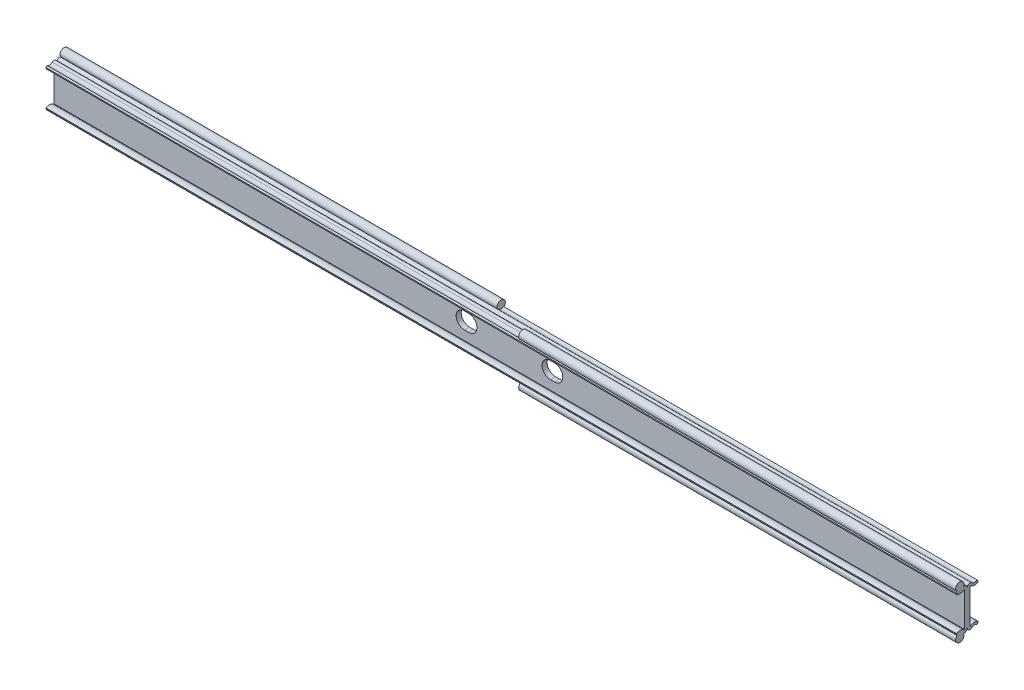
ISO-10303-21;
HEADER;
FILE_DESCRIPTION(('STEP AP214'),'2;1');
FILE_NAME('part.step','',(''),(''),'','','');
FILE_SCHEMA(('AUTOMOTIVE_DESIGN { 1 0 10303 214 1 1 1 1 }'));
ENDSEC;
DATA;
#1=APPLICATION_CONTEXT('core data for automotive mechanical design processes');
#2=APPLICATION_PROTOCOL_DEFINITION('international standard','automotive_design',2000,#1);
#3=PRODUCT_CONTEXT('',#1,'mechanical');
#4=PRODUCT('Part','Part','',(#3));
#5=PRODUCT_RELATED_PRODUCT_CATEGORY('part','',(#4));
#6=PRODUCT_DEFINITION_FORMATION('','',#4);
#7=PRODUCT_DEFINITION_CONTEXT('part definition',#1,'design');
#8=PRODUCT_DEFINITION('design','',#6,#7);
#9=PRODUCT_DEFINITION_SHAPE('','',#8);
#10=(LENGTH_UNIT() NAMED_UNIT(*) SI_UNIT(.MILLI.,.METRE.));
#11=(NAMED_UNIT(*) PLANE_ANGLE_UNIT() SI_UNIT($,.RADIAN.));
#12=(NAMED_UNIT(*) SI_UNIT($,.STERADIAN.) SOLID_ANGLE_UNIT());
#13=UNCERTAINTY_MEASURE_WITH_UNIT(LENGTH_MEASURE(1.E-05),#10,'distance_accuracy_value','');
#14=(GEOMETRIC_REPRESENTATION_CONTEXT(3) GLOBAL_UNCERTAINTY_ASSIGNED_CONTEXT((#13)) GLOBAL_UNIT_ASSIGNED_CONTEXT((#10,
#11,#12)) REPRESENTATION_CONTEXT('',''));
#15=CARTESIAN_POINT('',(0.,0.,0.));
#16=DIRECTION('',(0.,0.,1.));
#17=DIRECTION('',(1.,0.,0.));
#18=AXIS2_PLACEMENT_3D('',#15,#16,#17);
#19=CARTESIAN_POINT('',(-279.4,13.9149993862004,4.44999974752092));
#20=DIRECTION('',(1.,0.,0.));
#21=DIRECTION('',(0.,0.,-1.));
#22=AXIS2_PLACEMENT_3D('',#19,#20,#21);
#23=CYLINDRICAL_SURFACE('',#22,2.54999999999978);
#24=CARTESIAN_POINT('',(11.2,13.9149993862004,4.44999974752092));
#25=DIRECTION('',(1.,0.,0.));
#26=DIRECTION('',(0.,0.,-1.));
#27=AXIS2_PLACEMENT_3D('',#24,#25,#26);
#28=CIRCLE('',#27,2.54999999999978);
#29=CARTESIAN_POINT('',(11.2,12.0059660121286,2.75941062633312));
#30=VERTEX_POINT('',#29);
#31=CARTESIAN_POINT('',(11.2,11.8784793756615,5.98462877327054));
#32=VERTEX_POINT('',#31);
#33=EDGE_CURVE('E323',#30,#32,#28,.F.);
#34=ORIENTED_EDGE('',*,*,#33,.F.);
#35=DIRECTION('',(1.,0.,0.));
#36=VECTOR('',#35,1.);
#37=CARTESIAN_POINT('',(-279.4,12.0059660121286,2.75941062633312));
#38=LINE('',#37,#36);
#39=CARTESIAN_POINT('',(-279.4,12.0059660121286,2.75941062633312));
#40=VERTEX_POINT('',#39);
#41=EDGE_CURVE('E548',#40,#30,#38,.T.);
#42=ORIENTED_EDGE('',*,*,#41,.F.);
#43=CARTESIAN_POINT('',(-279.4,13.9149993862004,4.44999974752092));
#44=DIRECTION('',(1.,0.,0.));
#45=DIRECTION('',(0.,0.,1.));
#46=AXIS2_PLACEMENT_3D('',#43,#44,#45);
#47=CIRCLE('',#46,2.54999999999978);
#48=CARTESIAN_POINT('',(-279.4,11.8784793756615,5.98462877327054));
#49=VERTEX_POINT('',#48);
#50=EDGE_CURVE('E504',#49,#40,#47,.T.);
#51=ORIENTED_EDGE('',*,*,#50,.F.);
#52=DIRECTION('',(1.,0.,0.));
#53=VECTOR('',#52,1.);
#54=CARTESIAN_POINT('',(-279.4,11.8784793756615,5.98462877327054));
#55=LINE('',#54,#53);
#56=EDGE_CURVE('E551',#49,#32,#55,.T.);
#57=ORIENTED_EDGE('',*,*,#56,.T.);
#58=EDGE_LOOP('',(#34,#42,#51,#57));
#59=FACE_BOUND('',#58,.T.);
#60=ADVANCED_FACE('F14',(#59),#23,.F.);
#61=CARTESIAN_POINT('',(-279.4,13.9149993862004,-4.44999974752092));
#62=DIRECTION('',(1.,0.,0.));
#63=DIRECTION('',(0.,0.,-1.));
#64=AXIS2_PLACEMENT_3D('',#61,#62,#63);
#65=CYLINDRICAL_SURFACE('',#64,2.54999999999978);
#66=CARTESIAN_POINT('',(-11.2,13.9149993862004,-4.44999974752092));
#67=DIRECTION('',(-1.,0.,0.));
#68=DIRECTION('',(0.,0.,1.));
#69=AXIS2_PLACEMENT_3D('',#66,#67,#68);
#70=CIRCLE('',#69,2.54999999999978);
#71=CARTESIAN_POINT('',(-11.2,12.0059660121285,-2.75941062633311));
#72=VERTEX_POINT('',#71);
#73=CARTESIAN_POINT('',(-11.2,11.8784793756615,-5.98462877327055));
#74=VERTEX_POINT('',#73);
#75=EDGE_CURVE('E357',#72,#74,#70,.F.);
#76=ORIENTED_EDGE('',*,*,#75,.F.);
#77=DIRECTION('',(1.,0.,0.));
#78=VECTOR('',#77,1.);
#79=CARTESIAN_POINT('',(-279.4,12.0059660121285,-2.75941062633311));
#80=LINE('',#79,#78);
#81=CARTESIAN_POINT('',(279.4,12.0059660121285,-2.75941062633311));
#82=VERTEX_POINT('',#81);
#83=EDGE_CURVE('E543',#72,#82,#80,.T.);
#84=ORIENTED_EDGE('',*,*,#83,.T.);
#85=CARTESIAN_POINT('',(279.4,13.9149993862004,-4.44999974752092));
#86=DIRECTION('',(1.,0.,0.));
#87=DIRECTION('',(0.,0.,-1.));
#88=AXIS2_PLACEMENT_3D('',#85,#86,#87);
#89=CIRCLE('',#88,2.54999999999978);
#90=CARTESIAN_POINT('',(279.4,11.8784793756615,-5.98462877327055));
#91=VERTEX_POINT('',#90);
#92=EDGE_CURVE('E457',#82,#91,#89,.T.);
#93=ORIENTED_EDGE('',*,*,#92,.T.);
#94=DIRECTION('',(1.,0.,0.));
#95=VECTOR('',#94,1.);
#96=CARTESIAN_POINT('',(-279.4,11.8784793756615,-5.98462877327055));
#97=LINE('',#96,#95);
#98=EDGE_CURVE('E541',#74,#91,#97,.T.);
#99=ORIENTED_EDGE('',*,*,#98,.F.);
#100=EDGE_LOOP('',(#76,#84,#93,#99));
#101=FACE_BOUND('',#100,.T.);
#102=ADVANCED_FACE('F682',(#101),#65,.F.);
#103=CARTESIAN_POINT('',(-279.4,-13.9149993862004,-4.44999974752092));
#104=DIRECTION('',(1.,0.,0.));
#105=DIRECTION('',(0.,0.,-1.));
#106=AXIS2_PLACEMENT_3D('',#103,#104,#105);
#107=CYLINDRICAL_SURFACE('',#106,4.09999984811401);
#108=CARTESIAN_POINT('',(279.4,-13.9149993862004,-4.44999974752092));
#109=DIRECTION('',(-1.,0.,0.));
#110=DIRECTION('',(0.,0.,-1.));
#111=AXIS2_PLACEMENT_3D('',#108,#109,#110);
#112=CIRCLE('',#111,4.09999984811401);
#113=CARTESIAN_POINT('',(279.4,-10.8444021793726,-1.73312073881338));
#114=VERTEX_POINT('',#113);
#115=CARTESIAN_POINT('',(279.4,-10.4239395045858,-6.59999966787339));
#116=VERTEX_POINT('',#115);
#117=EDGE_CURVE('E423',#114,#116,#112,.T.);
#118=ORIENTED_EDGE('',*,*,#117,.T.);
#119=DIRECTION('',(1.,0.,0.));
#120=VECTOR('',#119,1.);
#121=CARTESIAN_POINT('',(-279.4,-10.4239395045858,-6.59999966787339));
#122=LINE('',#121,#120);
#123=CARTESIAN_POINT('',(-279.4,-10.4239395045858,-6.59999966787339));
#124=VERTEX_POINT('',#123);
#125=EDGE_CURVE('E591',#124,#116,#122,.T.);
#126=ORIENTED_EDGE('',*,*,#125,.F.);
#127=CARTESIAN_POINT('',(-279.4,-13.9149993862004,-4.44999974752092));
#128=DIRECTION('',(-1.,0.,0.));
#129=DIRECTION('',(0.,0.,-1.));
#130=AXIS2_PLACEMENT_3D('',#127,#128,#129);
#131=CIRCLE('',#130,4.09999984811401);
#132=CARTESIAN_POINT('',(-279.4,-10.8444021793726,-1.73312073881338));
#133=VERTEX_POINT('',#132);
#134=EDGE_CURVE('E472',#133,#124,#131,.T.);
#135=ORIENTED_EDGE('',*,*,#134,.F.);
#136=DIRECTION('',(1.,0.,0.));
#137=VECTOR('',#136,1.);
#138=CARTESIAN_POINT('',(-279.4,-10.8444021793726,-1.73312073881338));
#139=LINE('',#138,#137);
#140=EDGE_CURVE('E523',#133,#114,#139,.T.);
#141=ORIENTED_EDGE('',*,*,#140,.T.);
#142=EDGE_LOOP('',(#118,#126,#135,#141));
#143=FACE_BOUND('',#142,.T.);
#144=ADVANCED_FACE('F16',(#143),#107,.T.);
#145=CARTESIAN_POINT('',(-279.4,-11.0618535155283,-6.59999966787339));
#146=DIRECTION('',(0.,0.,1.));
#147=DIRECTION('',(1.,0.,0.));
#148=AXIS2_PLACEMENT_3D('',#145,#146,#147);
#149=PLANE('',#148);
#150=DIRECTION('',(0.,-1.,0.));
#151=VECTOR('',#150,1.);
#152=CARTESIAN_POINT('',(279.4,-11.0618535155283,-6.59999966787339));
#153=LINE('',#152,#151);
#154=CARTESIAN_POINT('',(279.4,-11.0618535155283,-6.59999966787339));
#155=VERTEX_POINT('',#154);
#156=EDGE_CURVE('E426',#116,#155,#153,.T.);
#157=ORIENTED_EDGE('',*,*,#156,.T.);
#158=DIRECTION('',(1.,0.,0.));
#159=VECTOR('',#158,1.);
#160=CARTESIAN_POINT('',(-279.4,-11.0618535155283,-6.59999966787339));
#161=LINE('',#160,#159);
#162=CARTESIAN_POINT('',(-279.4,-11.0618535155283,-6.59999966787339));
#163=VERTEX_POINT('',#162);
#164=EDGE_CURVE('E588',#163,#155,#161,.T.);
#165=ORIENTED_EDGE('',*,*,#164,.F.);
#166=DIRECTION('',(0.,-1.,0.));
#167=VECTOR('',#166,1.);
#168=CARTESIAN_POINT('',(-279.4,-11.0618535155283,-6.59999966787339));
#169=LINE('',#168,#167);
#170=EDGE_CURVE('E475',#124,#163,#169,.T.);
#171=ORIENTED_EDGE('',*,*,#170,.F.);
#172=ORIENTED_EDGE('',*,*,#125,.T.);
#173=EDGE_LOOP('',(#157,#165,#171,#172));
#174=FACE_BOUND('',#173,.T.);
#175=ADVANCED_FACE('F727',(#174),#149,.F.);
#176=CARTESIAN_POINT('',(-279.4,-11.8784793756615,-5.98462877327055));
#177=DIRECTION('',(0.,0.601814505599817,0.79863590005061));
#178=DIRECTION('',(0.,0.79863590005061,-0.601814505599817));
#179=AXIS2_PLACEMENT_3D('',#176,#177,#178);
#180=PLANE('',#179);
#181=DIRECTION('',(0.,0.79863590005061,-0.601814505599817));
#182=VECTOR('',#181,1.);
#183=CARTESIAN_POINT('',(-11.2,-11.8784793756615,-5.98462877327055));
#184=LINE('',#183,#182);
#185=CARTESIAN_POINT('',(-11.2,-11.8784793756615,-5.98462877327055));
#186=VERTEX_POINT('',#185);
#187=CARTESIAN_POINT('',(-11.2,-11.6159967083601,-6.18242338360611));
#188=VERTEX_POINT('',#187);
#189=EDGE_CURVE('E343',#186,#188,#184,.T.);
#190=ORIENTED_EDGE('',*,*,#189,.T.);
#191=DIRECTION('',(-1.,0.,0.));
#192=VECTOR('',#191,1.);
#193=CARTESIAN_POINT('',(-11.2,-11.6159967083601,-6.18242338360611));
#194=LINE('',#193,#192);
#195=CARTESIAN_POINT('',(-279.4,-11.6159967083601,-6.18242338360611));
#196=VERTEX_POINT('',#195);
#197=EDGE_CURVE('E337',#188,#196,#194,.T.);
#198=ORIENTED_EDGE('',*,*,#197,.T.);
#199=DIRECTION('',(0.,-0.79863590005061,0.601814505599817));
#200=VECTOR('',#199,1.);
#201=CARTESIAN_POINT('',(-279.4,-11.8784793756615,-5.98462877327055));
#202=LINE('',#201,#200);
#203=EDGE_CURVE('E477',#163,#196,#202,.T.);
#204=ORIENTED_EDGE('',*,*,#203,.F.);
#205=ORIENTED_EDGE('',*,*,#164,.T.);
#206=DIRECTION('',(0.,-0.79863590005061,0.601814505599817));
#207=VECTOR('',#206,1.);
#208=CARTESIAN_POINT('',(279.4,-11.8784793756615,-5.98462877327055));
#209=LINE('',#208,#207);
#210=CARTESIAN_POINT('',(279.4,-11.8784793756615,-5.98462877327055));
#211=VERTEX_POINT('',#210);
#212=EDGE_CURVE('E428',#155,#211,#209,.T.);
#213=ORIENTED_EDGE('',*,*,#212,.T.);
#214=DIRECTION('',(1.,0.,0.));
#215=VECTOR('',#214,1.);
#216=CARTESIAN_POINT('',(-279.4,-11.8784793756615,-5.98462877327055));
#217=LINE('',#216,#215);
#218=EDGE_CURVE('E586',#186,#211,#217,.T.);
#219=ORIENTED_EDGE('',*,*,#218,.F.);
#220=EDGE_LOOP('',(#190,#198,#204,#205,#213,#219));
#221=FACE_BOUND('',#220,.T.);
#222=ADVANCED_FACE('F724',(#221),#180,.F.);
#223=CARTESIAN_POINT('',(-279.4,-13.9149993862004,-4.44999974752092));
#224=DIRECTION('',(1.,0.,0.));
#225=DIRECTION('',(0.,0.,-1.));
#226=AXIS2_PLACEMENT_3D('',#223,#224,#225);
#227=CYLINDRICAL_SURFACE('',#226,2.54999999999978);
#228=DIRECTION('',(1.,0.,0.));
#229=VECTOR('',#228,1.);
#230=CARTESIAN_POINT('',(-279.4,-12.0059660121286,-2.75941062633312));
#231=LINE('',#230,#229);
#232=CARTESIAN_POINT('',(-11.2,-12.0059660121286,-2.75941062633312));
#233=VERTEX_POINT('',#232);
#234=CARTESIAN_POINT('',(279.4,-12.0059660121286,-2.75941062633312));
#235=VERTEX_POINT('',#234);
#236=EDGE_CURVE('E584',#233,#235,#231,.T.);
#237=ORIENTED_EDGE('',*,*,#236,.F.);
#238=CARTESIAN_POINT('',(-11.2,-13.9149993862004,-4.44999974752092));
#239=DIRECTION('',(1.,0.,0.));
#240=DIRECTION('',(0.,0.,-1.));
#241=AXIS2_PLACEMENT_3D('',#238,#239,#240);
#242=CIRCLE('',#241,2.54999999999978);
#243=EDGE_CURVE('E340',#233,#186,#242,.F.);
#244=ORIENTED_EDGE('',*,*,#243,.T.);
#245=ORIENTED_EDGE('',*,*,#218,.T.);
#246=CARTESIAN_POINT('',(279.4,-13.9149993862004,-4.44999974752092));
#247=DIRECTION('',(1.,0.,0.));
#248=DIRECTION('',(0.,0.,1.));
#249=AXIS2_PLACEMENT_3D('',#246,#247,#248);
#250=CIRCLE('',#249,2.54999999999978);
#251=EDGE_CURVE('E431',#211,#235,#250,.T.);
#252=ORIENTED_EDGE('',*,*,#251,.T.);
#253=EDGE_LOOP('',(#237,#244,#245,#252));
#254=FACE_BOUND('',#253,.T.);
#255=ADVANCED_FACE('F720',(#254),#227,.F.);
#256=CARTESIAN_POINT('',(-279.4,-10.7622235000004,-1.65999984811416));
#257=DIRECTION('',(1.,0.,0.));
#258=DIRECTION('',(0.,0.,-1.));
#259=AXIS2_PLACEMENT_3D('',#256,#257,#258);
#260=CYLINDRICAL_SURFACE('',#259,1.65999984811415);
#261=CARTESIAN_POINT('',(-279.4,-10.7622235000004,-1.65999984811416));
#262=DIRECTION('',(-1.,0.,0.));
#263=DIRECTION('',(0.,0.,-1.));
#264=AXIS2_PLACEMENT_3D('',#261,#262,#263);
#265=CIRCLE('',#264,1.65999984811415);
#266=CARTESIAN_POINT('',(-279.4,-12.2669165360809,-2.36106929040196));
#267=VERTEX_POINT('',#266);
#268=CARTESIAN_POINT('',(-279.4,-10.7622235,0.));
#269=VERTEX_POINT('',#268);
#270=EDGE_CURVE('E480',#267,#269,#265,.T.);
#271=ORIENTED_EDGE('',*,*,#270,.F.);
#272=DIRECTION('',(-1.,0.,0.));
#273=VECTOR('',#272,1.);
#274=CARTESIAN_POINT('',(-145.3,-12.2669165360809,-2.36106929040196));
#275=LINE('',#274,#273);
#276=CARTESIAN_POINT('',(-11.2,-12.2669165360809,-2.36106929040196));
#277=VERTEX_POINT('',#276);
#278=EDGE_CURVE('E333',#267,#277,#275,.F.);
#279=ORIENTED_EDGE('',*,*,#278,.T.);
#280=CARTESIAN_POINT('',(-11.2,-10.7622235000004,-1.65999984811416));
#281=DIRECTION('',(1.,0.,0.));
#282=DIRECTION('',(0.,0.,-1.));
#283=AXIS2_PLACEMENT_3D('',#280,#281,#282);
#284=CIRCLE('',#283,1.65999984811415);
#285=EDGE_CURVE('E596',#277,#233,#284,.T.);
#286=ORIENTED_EDGE('',*,*,#285,.T.);
#287=ORIENTED_EDGE('',*,*,#236,.T.);
#288=CARTESIAN_POINT('',(279.4,-10.7622235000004,-1.65999984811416));
#289=DIRECTION('',(-1.,0.,0.));
#290=DIRECTION('',(0.,0.,-1.));
#291=AXIS2_PLACEMENT_3D('',#288,#289,#290);
#292=CIRCLE('',#291,1.65999984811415);
#293=CARTESIAN_POINT('',(279.4,-10.7622235,0.));
#294=VERTEX_POINT('',#293);
#295=EDGE_CURVE('E434',#235,#294,#292,.T.);
#296=ORIENTED_EDGE('',*,*,#295,.T.);
#297=DIRECTION('',(1.,0.,0.));
#298=VECTOR('',#297,1.);
#299=CARTESIAN_POINT('',(-279.4,-10.7622235,0.));
#300=LINE('',#299,#298);
#301=EDGE_CURVE('E581',#269,#294,#300,.T.);
#302=ORIENTED_EDGE('',*,*,#301,.F.);
#303=EDGE_LOOP('',(#271,#279,#286,#287,#296,#302));
#304=FACE_BOUND('',#303,.T.);
#305=ADVANCED_FACE('F717',(#304),#260,.T.);
#306=CARTESIAN_POINT('',(-279.4,-10.7622235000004,1.65999984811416));
#307=DIRECTION('',(1.,0.,0.));
#308=DIRECTION('',(0.,0.,-1.));
#309=AXIS2_PLACEMENT_3D('',#306,#307,#308);
#310=CYLINDRICAL_SURFACE('',#309,1.65999984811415);
#311=CARTESIAN_POINT('',(279.4,-10.7622235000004,1.65999984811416));
#312=DIRECTION('',(-1.,0.,0.));
#313=DIRECTION('',(0.,0.,1.));
#314=AXIS2_PLACEMENT_3D('',#311,#312,#313);
#315=CIRCLE('',#314,1.65999984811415);
#316=CARTESIAN_POINT('',(279.4,-12.2669165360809,2.36106929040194));
#317=VERTEX_POINT('',#316);
#318=EDGE_CURVE('E292',#294,#317,#315,.T.);
#319=ORIENTED_EDGE('',*,*,#318,.T.);
#320=DIRECTION('',(1.,0.,0.));
#321=VECTOR('',#320,1.);
#322=CARTESIAN_POINT('',(145.3,-12.2669165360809,2.36106929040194));
#323=LINE('',#322,#321);
#324=CARTESIAN_POINT('',(11.2,-12.2669165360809,2.36106929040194));
#325=VERTEX_POINT('',#324);
#326=EDGE_CURVE('E29',#317,#325,#323,.F.);
#327=ORIENTED_EDGE('',*,*,#326,.T.);
#328=CARTESIAN_POINT('',(11.2,-10.7622235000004,1.65999984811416));
#329=DIRECTION('',(-1.,0.,0.));
#330=DIRECTION('',(0.,0.,1.));
#331=AXIS2_PLACEMENT_3D('',#328,#329,#330);
#332=CIRCLE('',#331,1.65999984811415);
#333=CARTESIAN_POINT('',(11.2,-12.0059660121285,2.75941062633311));
#334=VERTEX_POINT('',#333);
#335=EDGE_CURVE('E33',#325,#334,#332,.T.);
#336=ORIENTED_EDGE('',*,*,#335,.T.);
#337=DIRECTION('',(1.,0.,0.));
#338=VECTOR('',#337,1.);
#339=CARTESIAN_POINT('',(-279.4,-12.0059660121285,2.75941062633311));
#340=LINE('',#339,#338);
#341=CARTESIAN_POINT('',(-279.4,-12.0059660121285,2.75941062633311));
#342=VERTEX_POINT('',#341);
#343=EDGE_CURVE('E579',#342,#334,#340,.T.);
#344=ORIENTED_EDGE('',*,*,#343,.F.);
#345=CARTESIAN_POINT('',(-279.4,-10.7622235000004,1.65999984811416));
#346=DIRECTION('',(-1.,0.,0.));
#347=DIRECTION('',(0.,0.,1.));
#348=AXIS2_PLACEMENT_3D('',#345,#346,#347);
#349=CIRCLE('',#348,1.65999984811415);
#350=EDGE_CURVE('E482',#269,#342,#349,.T.);
#351=ORIENTED_EDGE('',*,*,#350,.F.);
#352=ORIENTED_EDGE('',*,*,#301,.T.);
#353=EDGE_LOOP('',(#319,#327,#336,#344,#351,#352));
#354=FACE_BOUND('',#353,.T.);
#355=ADVANCED_FACE('F714',(#354),#310,.T.);
#356=CARTESIAN_POINT('',(-279.4,-13.9149993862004,4.44999974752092));
#357=DIRECTION('',(1.,0.,0.));
#358=DIRECTION('',(0.,0.,-1.));
#359=AXIS2_PLACEMENT_3D('',#356,#357,#358);
#360=CYLINDRICAL_SURFACE('',#359,2.54999999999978);
#361=ORIENTED_EDGE('',*,*,#343,.T.);
#362=CARTESIAN_POINT('',(11.2,-13.9149993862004,4.44999974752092));
#363=DIRECTION('',(-1.,0.,0.));
#364=DIRECTION('',(0.,0.,1.));
#365=AXIS2_PLACEMENT_3D('',#362,#363,#364);
#366=CIRCLE('',#365,2.54999999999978);
#367=CARTESIAN_POINT('',(11.2,-11.8784793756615,5.98462877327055));
#368=VERTEX_POINT('',#367);
#369=EDGE_CURVE('E309',#334,#368,#366,.F.);
#370=ORIENTED_EDGE('',*,*,#369,.T.);
#371=DIRECTION('',(1.,0.,0.));
#372=VECTOR('',#371,1.);
#373=CARTESIAN_POINT('',(-279.4,-11.8784793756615,5.98462877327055));
#374=LINE('',#373,#372);
#375=CARTESIAN_POINT('',(-279.4,-11.8784793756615,5.98462877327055));
#376=VERTEX_POINT('',#375);
#377=EDGE_CURVE('E577',#376,#368,#374,.T.);
#378=ORIENTED_EDGE('',*,*,#377,.F.);
#379=CARTESIAN_POINT('',(-279.4,-13.9149993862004,4.44999974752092));
#380=DIRECTION('',(1.,0.,0.));
#381=DIRECTION('',(0.,0.,-1.));
#382=AXIS2_PLACEMENT_3D('',#379,#380,#381);
#383=CIRCLE('',#382,2.54999999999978);
#384=EDGE_CURVE('E484',#342,#376,#383,.T.);
#385=ORIENTED_EDGE('',*,*,#384,.F.);
#386=EDGE_LOOP('',(#361,#370,#378,#385));
#387=FACE_BOUND('',#386,.T.);
#388=ADVANCED_FACE('F667',(#387),#360,.F.);
#389=CARTESIAN_POINT('',(-279.4,-11.8784793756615,5.98462877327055));
#390=DIRECTION('',(0.,0.601814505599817,-0.79863590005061));
#391=DIRECTION('',(0.,-0.79863590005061,-0.601814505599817));
#392=AXIS2_PLACEMENT_3D('',#389,#390,#391);
#393=PLANE('',#392);
#394=DIRECTION('',(0.,0.79863590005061,0.601814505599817));
#395=VECTOR('',#394,1.);
#396=CARTESIAN_POINT('',(11.2,-11.8784793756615,5.98462877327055));
#397=LINE('',#396,#395);
#398=CARTESIAN_POINT('',(11.2,-11.6159967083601,6.18242338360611));
#399=VERTEX_POINT('',#398);
#400=EDGE_CURVE('E9',#368,#399,#397,.T.);
#401=ORIENTED_EDGE('',*,*,#400,.T.);
#402=DIRECTION('',(1.,0.,0.));
#403=VECTOR('',#402,1.);
#404=CARTESIAN_POINT('',(11.2,-11.6159967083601,6.18242338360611));
#405=LINE('',#404,#403);
#406=CARTESIAN_POINT('',(279.4,-11.6159967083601,6.18242338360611));
#407=VERTEX_POINT('',#406);
#408=EDGE_CURVE('E295',#399,#407,#405,.T.);
#409=ORIENTED_EDGE('',*,*,#408,.T.);
#410=DIRECTION('',(0.,0.79863590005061,0.601814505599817));
#411=VECTOR('',#410,1.);
#412=CARTESIAN_POINT('',(279.4,-11.8784793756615,5.98462877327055));
#413=LINE('',#412,#411);
#414=CARTESIAN_POINT('',(279.4,-11.0618535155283,6.59999966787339));
#415=VERTEX_POINT('',#414);
#416=EDGE_CURVE('E281',#407,#415,#413,.T.);
#417=ORIENTED_EDGE('',*,*,#416,.T.);
#418=DIRECTION('',(1.,0.,0.));
#419=VECTOR('',#418,1.);
#420=CARTESIAN_POINT('',(-279.4,-11.0618535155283,6.59999966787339));
#421=LINE('',#420,#419);
#422=CARTESIAN_POINT('',(-279.4,-11.0618535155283,6.59999966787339));
#423=VERTEX_POINT('',#422);
#424=EDGE_CURVE('E575',#423,#415,#421,.T.);
#425=ORIENTED_EDGE('',*,*,#424,.F.);
#426=DIRECTION('',(0.,0.79863590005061,0.601814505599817));
#427=VECTOR('',#426,1.);
#428=CARTESIAN_POINT('',(-279.4,-11.8784793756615,5.98462877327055));
#429=LINE('',#428,#427);
#430=EDGE_CURVE('E486',#376,#423,#429,.T.);
#431=ORIENTED_EDGE('',*,*,#430,.F.);
#432=ORIENTED_EDGE('',*,*,#377,.T.);
#433=EDGE_LOOP('',(#401,#409,#417,#425,#431,#432));
#434=FACE_BOUND('',#433,.T.);
#435=ADVANCED_FACE('F296',(#434),#393,.F.);
#436=CARTESIAN_POINT('',(-279.4,-11.0618535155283,6.59999966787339));
#437=DIRECTION('',(0.,0.,-1.));
#438=DIRECTION('',(-1.,0.,0.));
#439=AXIS2_PLACEMENT_3D('',#436,#437,#438);
#440=PLANE('',#439);
#441=DIRECTION('',(0.,1.,0.));
#442=VECTOR('',#441,1.);
#443=CARTESIAN_POINT('',(279.4,-11.0618535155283,6.59999966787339));
#444=LINE('',#443,#442);
#445=CARTESIAN_POINT('',(279.4,-10.4239395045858,6.59999966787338));
#446=VERTEX_POINT('',#445);
#447=EDGE_CURVE('E288',#415,#446,#444,.T.);
#448=ORIENTED_EDGE('',*,*,#447,.T.);
#449=DIRECTION('',(1.,0.,0.));
#450=VECTOR('',#449,1.);
#451=CARTESIAN_POINT('',(-279.4,-10.4239395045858,6.59999966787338));
#452=LINE('',#451,#450);
#453=CARTESIAN_POINT('',(-279.4,-10.4239395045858,6.59999966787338));
#454=VERTEX_POINT('',#453);
#455=EDGE_CURVE('E572',#454,#446,#452,.T.);
#456=ORIENTED_EDGE('',*,*,#455,.F.);
#457=DIRECTION('',(0.,1.,0.));
#458=VECTOR('',#457,1.);
#459=CARTESIAN_POINT('',(-279.4,-11.0618535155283,6.59999966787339));
#460=LINE('',#459,#458);
#461=EDGE_CURVE('E488',#423,#454,#460,.T.);
#462=ORIENTED_EDGE('',*,*,#461,.F.);
#463=ORIENTED_EDGE('',*,*,#424,.T.);
#464=EDGE_LOOP('',(#448,#456,#462,#463));
#465=FACE_BOUND('',#464,.T.);
#466=ADVANCED_FACE('F661',(#465),#440,.F.);
#467=CARTESIAN_POINT('',(-279.4,-13.9149993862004,4.44999974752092));
#468=DIRECTION('',(1.,0.,0.));
#469=DIRECTION('',(0.,0.,-1.));
#470=AXIS2_PLACEMENT_3D('',#467,#468,#469);
#471=CYLINDRICAL_SURFACE('',#470,4.09999984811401);
#472=CARTESIAN_POINT('',(279.4,-13.9149993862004,4.44999974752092));
#473=DIRECTION('',(-1.,0.,0.));
#474=DIRECTION('',(0.,0.,1.));
#475=AXIS2_PLACEMENT_3D('',#472,#473,#474);
#476=CIRCLE('',#475,4.09999984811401);
#477=CARTESIAN_POINT('',(279.4,-10.8444021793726,1.73312073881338));
#478=VERTEX_POINT('',#477);
#479=EDGE_CURVE('E438',#446,#478,#476,.T.);
#480=ORIENTED_EDGE('',*,*,#479,.T.);
#481=DIRECTION('',(1.,0.,0.));
#482=VECTOR('',#481,1.);
#483=CARTESIAN_POINT('',(-279.4,-10.8444021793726,1.73312073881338));
#484=LINE('',#483,#482);
#485=CARTESIAN_POINT('',(-279.4,-10.8444021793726,1.73312073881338));
#486=VERTEX_POINT('',#485);
#487=EDGE_CURVE('E569',#486,#478,#484,.T.);
#488=ORIENTED_EDGE('',*,*,#487,.F.);
#489=CARTESIAN_POINT('',(-279.4,-13.9149993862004,4.44999974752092));
#490=DIRECTION('',(-1.,0.,0.));
#491=DIRECTION('',(0.,0.,1.));
#492=AXIS2_PLACEMENT_3D('',#489,#490,#491);
#493=CIRCLE('',#492,4.09999984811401);
#494=EDGE_CURVE('E490',#454,#486,#493,.T.);
#495=ORIENTED_EDGE('',*,*,#494,.F.);
#496=ORIENTED_EDGE('',*,*,#455,.T.);
#497=EDGE_LOOP('',(#480,#488,#495,#496));
#498=FACE_BOUND('',#497,.T.);
#499=ADVANCED_FACE('F657',(#498),#471,.T.);
#500=CARTESIAN_POINT('',(-279.4,-10.7622235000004,1.65999984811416));
#501=DIRECTION('',(1.,0.,0.));
#502=DIRECTION('',(0.,0.,-1.));
#503=AXIS2_PLACEMENT_3D('',#500,#501,#502);
#504=CYLINDRICAL_SURFACE('',#503,0.110000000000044);
#505=CARTESIAN_POINT('',(279.4,-10.7622235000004,1.65999984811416));
#506=DIRECTION('',(1.,0.,0.));
#507=DIRECTION('',(0.,0.,-1.));
#508=AXIS2_PLACEMENT_3D('',#505,#506,#507);
#509=CIRCLE('',#508,0.110000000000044);
#510=CARTESIAN_POINT('',(279.4,-10.7622235,1.5499998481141));
#511=VERTEX_POINT('',#510);
#512=EDGE_CURVE('E440',#478,#511,#509,.T.);
#513=ORIENTED_EDGE('',*,*,#512,.T.);
#514=DIRECTION('',(1.,0.,0.));
#515=VECTOR('',#514,1.);
#516=CARTESIAN_POINT('',(-279.4,-10.7622235,1.5499998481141));
#517=LINE('',#516,#515);
#518=CARTESIAN_POINT('',(-279.4,-10.7622235,1.5499998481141));
#519=VERTEX_POINT('',#518);
#520=EDGE_CURVE('E566',#519,#511,#517,.T.);
#521=ORIENTED_EDGE('',*,*,#520,.F.);
#522=CARTESIAN_POINT('',(-279.4,-10.7622235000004,1.65999984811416));
#523=DIRECTION('',(1.,0.,0.));
#524=DIRECTION('',(0.,0.,-1.));
#525=AXIS2_PLACEMENT_3D('',#522,#523,#524);
#526=CIRCLE('',#525,0.110000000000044);
#527=EDGE_CURVE('E492',#486,#519,#526,.T.);
#528=ORIENTED_EDGE('',*,*,#527,.F.);
#529=ORIENTED_EDGE('',*,*,#487,.T.);
#530=EDGE_LOOP('',(#513,#521,#528,#529));
#531=FACE_BOUND('',#530,.T.);
#532=ADVANCED_FACE('F652',(#531),#504,.F.);
#533=CARTESIAN_POINT('',(-279.4,10.7622235,1.5499998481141));
#534=DIRECTION('',(0.,0.,-1.));
#535=DIRECTION('',(-1.,0.,0.));
#536=AXIS2_PLACEMENT_3D('',#533,#534,#535);
#537=PLANE('',#536);
#538=DIRECTION('',(1.,0.,0.));
#539=VECTOR('',#538,1.);
#540=CARTESIAN_POINT('',(27.65,-5.05,1.5499998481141));
#541=LINE('',#540,#539);
#542=CARTESIAN_POINT('',(25.05,-5.05,1.5499998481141));
#543=VERTEX_POINT('',#542);
#544=CARTESIAN_POINT('',(27.65,-5.05,1.5499998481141));
#545=VERTEX_POINT('',#544);
#546=EDGE_CURVE('E371',#543,#545,#541,.T.);
#547=ORIENTED_EDGE('',*,*,#546,.F.);
#548=CARTESIAN_POINT('',(25.05,0.,1.5499998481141));
#549=DIRECTION('',(0.,0.,1.));
#550=DIRECTION('',(1.,0.,0.));
#551=AXIS2_PLACEMENT_3D('',#548,#549,#550);
#552=CIRCLE('',#551,5.05);
#553=CARTESIAN_POINT('',(25.05,5.05,1.5499998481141));
#554=VERTEX_POINT('',#553);
#555=EDGE_CURVE('E369',#554,#543,#552,.T.);
#556=ORIENTED_EDGE('',*,*,#555,.F.);
#557=DIRECTION('',(-1.,0.,0.));
#558=VECTOR('',#557,1.);
#559=CARTESIAN_POINT('',(25.05,5.05,1.5499998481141));
#560=LINE('',#559,#558);
#561=CARTESIAN_POINT('',(27.65,5.05,1.5499998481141));
#562=VERTEX_POINT('',#561);
#563=EDGE_CURVE('E377',#562,#554,#560,.T.);
#564=ORIENTED_EDGE('',*,*,#563,.F.);
#565=CARTESIAN_POINT('',(27.65,0.,1.5499998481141));
#566=DIRECTION('',(0.,0.,1.));
#567=DIRECTION('',(1.,0.,0.));
#568=AXIS2_PLACEMENT_3D('',#565,#566,#567);
#569=CIRCLE('',#568,5.05);
#570=EDGE_CURVE('E374',#545,#562,#569,.T.);
#571=ORIENTED_EDGE('',*,*,#570,.F.);
#572=EDGE_LOOP('',(#547,#556,#564,#571));
#573=FACE_BOUND('',#572,.T.);
#574=DIRECTION('',(1.,0.,0.));
#575=VECTOR('',#574,1.);
#576=CARTESIAN_POINT('',(-27.65,-5.05,1.5499998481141));
#577=LINE('',#576,#575);
#578=CARTESIAN_POINT('',(-27.65,-5.05,1.5499998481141));
#579=VERTEX_POINT('',#578);
#580=CARTESIAN_POINT('',(-25.05,-5.05,1.5499998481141));
#581=VERTEX_POINT('',#580);
#582=EDGE_CURVE('E402',#579,#581,#577,.T.);
#583=ORIENTED_EDGE('',*,*,#582,.F.);
#584=CARTESIAN_POINT('',(-27.65,0.,1.5499998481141));
#585=DIRECTION('',(0.,0.,1.));
#586=DIRECTION('',(-1.,0.,0.));
#587=AXIS2_PLACEMENT_3D('',#584,#585,#586);
#588=CIRCLE('',#587,5.05);
#589=CARTESIAN_POINT('',(-27.65,5.05,1.5499998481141));
#590=VERTEX_POINT('',#589);
#591=EDGE_CURVE('E400',#590,#579,#588,.T.);
#592=ORIENTED_EDGE('',*,*,#591,.F.);
#593=DIRECTION('',(-1.,0.,0.));
#594=VECTOR('',#593,1.);
#595=CARTESIAN_POINT('',(-25.05,5.05,1.5499998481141));
#596=LINE('',#595,#594);
#597=CARTESIAN_POINT('',(-25.05,5.05,1.5499998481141));
#598=VERTEX_POINT('',#597);
#599=EDGE_CURVE('E408',#598,#590,#596,.T.);
#600=ORIENTED_EDGE('',*,*,#599,.F.);
#601=CARTESIAN_POINT('',(-25.05,0.,1.5499998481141));
#602=DIRECTION('',(0.,0.,1.));
#603=DIRECTION('',(-1.,0.,0.));
#604=AXIS2_PLACEMENT_3D('',#601,#602,#603);
#605=CIRCLE('',#604,5.05);
#606=EDGE_CURVE('E405',#581,#598,#605,.T.);
#607=ORIENTED_EDGE('',*,*,#606,.F.);
#608=EDGE_LOOP('',(#583,#592,#600,#607));
#609=FACE_BOUND('',#608,.T.);
#610=DIRECTION('',(0.,1.,0.));
#611=VECTOR('',#610,1.);
#612=CARTESIAN_POINT('',(279.4,10.7622235,1.5499998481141));
#613=LINE('',#612,#611);
#614=CARTESIAN_POINT('',(279.4,10.7622235,1.54999984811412));
#615=VERTEX_POINT('',#614);
#616=EDGE_CURVE('E442',#511,#615,#613,.T.);
#617=ORIENTED_EDGE('',*,*,#616,.T.);
#618=DIRECTION('',(1.,0.,0.));
#619=VECTOR('',#618,1.);
#620=CARTESIAN_POINT('',(-279.4,10.7622235,1.54999984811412));
#621=LINE('',#620,#619);
#622=CARTESIAN_POINT('',(-279.4,10.7622235,1.54999984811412));
#623=VERTEX_POINT('',#622);
#624=EDGE_CURVE('E563',#623,#615,#621,.T.);
#625=ORIENTED_EDGE('',*,*,#624,.F.);
#626=DIRECTION('',(0.,1.,0.));
#627=VECTOR('',#626,1.);
#628=CARTESIAN_POINT('',(-279.4,10.7622235,1.5499998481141));
#629=LINE('',#628,#627);
#630=EDGE_CURVE('E494',#519,#623,#629,.T.);
#631=ORIENTED_EDGE('',*,*,#630,.F.);
#632=ORIENTED_EDGE('',*,*,#520,.T.);
#633=EDGE_LOOP('',(#617,#625,#631,#632));
#634=FACE_BOUND('',#633,.T.);
#635=ADVANCED_FACE('F648',(#573,#609,#634),#537,.F.);
#636=CARTESIAN_POINT('',(-279.4,10.7622235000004,1.65999984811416));
#637=DIRECTION('',(1.,0.,0.));
#638=DIRECTION('',(0.,0.,-1.));
#639=AXIS2_PLACEMENT_3D('',#636,#637,#638);
#640=CYLINDRICAL_SURFACE('',#639,0.110000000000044);
#641=CARTESIAN_POINT('',(279.4,10.7622235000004,1.65999984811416));
#642=DIRECTION('',(1.,0.,0.));
#643=DIRECTION('',(0.,0.,1.));
#644=AXIS2_PLACEMENT_3D('',#641,#642,#643);
#645=CIRCLE('',#644,0.110000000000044);
#646=CARTESIAN_POINT('',(279.4,10.8444021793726,1.73312073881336));
#647=VERTEX_POINT('',#646);
#648=EDGE_CURVE('E444',#615,#647,#645,.T.);
#649=ORIENTED_EDGE('',*,*,#648,.T.);
#650=DIRECTION('',(1.,0.,0.));
#651=VECTOR('',#650,1.);
#652=CARTESIAN_POINT('',(-279.4,10.8444021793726,1.73312073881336));
#653=LINE('',#652,#651);
#654=CARTESIAN_POINT('',(-279.4,10.8444021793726,1.73312073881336));
#655=VERTEX_POINT('',#654);
#656=EDGE_CURVE('E560',#655,#647,#653,.T.);
#657=ORIENTED_EDGE('',*,*,#656,.F.);
#658=CARTESIAN_POINT('',(-279.4,10.7622235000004,1.65999984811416));
#659=DIRECTION('',(1.,0.,0.));
#660=DIRECTION('',(0.,0.,1.));
#661=AXIS2_PLACEMENT_3D('',#658,#659,#660);
#662=CIRCLE('',#661,0.110000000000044);
#663=EDGE_CURVE('E496',#623,#655,#662,.T.);
#664=ORIENTED_EDGE('',*,*,#663,.F.);
#665=ORIENTED_EDGE('',*,*,#624,.T.);
#666=EDGE_LOOP('',(#649,#657,#664,#665));
#667=FACE_BOUND('',#666,.T.);
#668=ADVANCED_FACE('F644',(#667),#640,.F.);
#669=CARTESIAN_POINT('',(-279.4,13.9149993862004,4.44999974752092));
#670=DIRECTION('',(1.,0.,0.));
#671=DIRECTION('',(0.,0.,-1.));
#672=AXIS2_PLACEMENT_3D('',#669,#670,#671);
#673=CYLINDRICAL_SURFACE('',#672,4.09999984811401);
#674=CARTESIAN_POINT('',(279.4,13.9149993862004,4.44999974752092));
#675=DIRECTION('',(-1.,0.,0.));
#676=DIRECTION('',(0.,0.,-1.));
#677=AXIS2_PLACEMENT_3D('',#674,#675,#676);
#678=CIRCLE('',#677,4.09999984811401);
#679=CARTESIAN_POINT('',(279.4,10.4239395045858,6.59999966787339));
#680=VERTEX_POINT('',#679);
#681=EDGE_CURVE('E446',#647,#680,#678,.T.);
#682=ORIENTED_EDGE('',*,*,#681,.T.);
#683=DIRECTION('',(1.,0.,0.));
#684=VECTOR('',#683,1.);
#685=CARTESIAN_POINT('',(-279.4,10.4239395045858,6.59999966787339));
#686=LINE('',#685,#684);
#687=CARTESIAN_POINT('',(-279.4,10.4239395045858,6.59999966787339));
#688=VERTEX_POINT('',#687);
#689=EDGE_CURVE('E557',#688,#680,#686,.T.);
#690=ORIENTED_EDGE('',*,*,#689,.F.);
#691=CARTESIAN_POINT('',(-279.4,13.9149993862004,4.44999974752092));
#692=DIRECTION('',(-1.,0.,0.));
#693=DIRECTION('',(0.,0.,-1.));
#694=AXIS2_PLACEMENT_3D('',#691,#692,#693);
#695=CIRCLE('',#694,4.09999984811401);
#696=EDGE_CURVE('E498',#655,#688,#695,.T.);
#697=ORIENTED_EDGE('',*,*,#696,.F.);
#698=ORIENTED_EDGE('',*,*,#656,.T.);
#699=EDGE_LOOP('',(#682,#690,#697,#698));
#700=FACE_BOUND('',#699,.T.);
#701=ADVANCED_FACE('F639',(#700),#673,.T.);
#702=CARTESIAN_POINT('',(-279.4,11.0618535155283,6.59999966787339));
#703=DIRECTION('',(0.,0.,-1.));
#704=DIRECTION('',(-1.,0.,0.));
#705=AXIS2_PLACEMENT_3D('',#702,#703,#704);
#706=PLANE('',#705);
#707=DIRECTION('',(0.,1.,0.));
#708=VECTOR('',#707,1.);
#709=CARTESIAN_POINT('',(279.4,11.0618535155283,6.59999966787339));
#710=LINE('',#709,#708);
#711=CARTESIAN_POINT('',(279.4,11.0618535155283,6.59999966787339));
#712=VERTEX_POINT('',#711);
#713=EDGE_CURVE('E448',#680,#712,#710,.T.);
#714=ORIENTED_EDGE('',*,*,#713,.T.);
#715=DIRECTION('',(1.,0.,0.));
#716=VECTOR('',#715,1.);
#717=CARTESIAN_POINT('',(-279.4,11.0618535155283,6.59999966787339));
#718=LINE('',#717,#716);
#719=CARTESIAN_POINT('',(-279.4,11.0618535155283,6.59999966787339));
#720=VERTEX_POINT('',#719);
#721=EDGE_CURVE('E554',#720,#712,#718,.T.);
#722=ORIENTED_EDGE('',*,*,#721,.F.);
#723=DIRECTION('',(0.,1.,0.));
#724=VECTOR('',#723,1.);
#725=CARTESIAN_POINT('',(-279.4,11.0618535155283,6.59999966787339));
#726=LINE('',#725,#724);
#727=EDGE_CURVE('E500',#688,#720,#726,.T.);
#728=ORIENTED_EDGE('',*,*,#727,.F.);
#729=ORIENTED_EDGE('',*,*,#689,.T.);
#730=EDGE_LOOP('',(#714,#722,#728,#729));
#731=FACE_BOUND('',#730,.T.);
#732=ADVANCED_FACE('F633',(#731),#706,.F.);
#733=CARTESIAN_POINT('',(-279.4,11.8784793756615,5.98462877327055));
#734=DIRECTION('',(0.,-0.601814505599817,-0.79863590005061));
#735=DIRECTION('',(0.,-0.79863590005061,0.601814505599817));
#736=AXIS2_PLACEMENT_3D('',#733,#734,#735);
#737=PLANE('',#736);
#738=DIRECTION('',(0.,0.79863590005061,-0.601814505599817));
#739=VECTOR('',#738,1.);
#740=CARTESIAN_POINT('',(279.4,11.8784793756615,5.98462877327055));
#741=LINE('',#740,#739);
#742=CARTESIAN_POINT('',(279.4,11.6159967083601,6.18242338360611));
#743=VERTEX_POINT('',#742);
#744=EDGE_CURVE('E450',#712,#743,#741,.T.);
#745=ORIENTED_EDGE('',*,*,#744,.T.);
#746=DIRECTION('',(1.,0.,0.));
#747=VECTOR('',#746,1.);
#748=CARTESIAN_POINT('',(11.2,11.6159967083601,6.18242338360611));
#749=LINE('',#748,#747);
#750=CARTESIAN_POINT('',(11.2,11.6159967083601,6.18242338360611));
#751=VERTEX_POINT('',#750);
#752=EDGE_CURVE('E321',#743,#751,#749,.F.);
#753=ORIENTED_EDGE('',*,*,#752,.T.);
#754=DIRECTION('',(0.,-0.79863590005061,0.601814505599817));
#755=VECTOR('',#754,1.);
#756=CARTESIAN_POINT('',(11.2,11.8784793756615,5.98462877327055));
#757=LINE('',#756,#755);
#758=EDGE_CURVE('E326',#32,#751,#757,.T.);
#759=ORIENTED_EDGE('',*,*,#758,.F.);
#760=ORIENTED_EDGE('',*,*,#56,.F.);
#761=DIRECTION('',(0.,0.79863590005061,-0.601814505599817));
#762=VECTOR('',#761,1.);
#763=CARTESIAN_POINT('',(-279.4,11.8784793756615,5.98462877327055));
#764=LINE('',#763,#762);
#765=EDGE_CURVE('E502',#720,#49,#764,.T.);
#766=ORIENTED_EDGE('',*,*,#765,.F.);
#767=ORIENTED_EDGE('',*,*,#721,.T.);
#768=EDGE_LOOP('',(#745,#753,#759,#760,#766,#767));
#769=FACE_BOUND('',#768,.T.);
#770=ADVANCED_FACE('F629',(#769),#737,.F.);
#771=CARTESIAN_POINT('',(-279.4,10.7622235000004,1.65999984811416));
#772=DIRECTION('',(1.,0.,0.));
#773=DIRECTION('',(0.,0.,-1.));
#774=AXIS2_PLACEMENT_3D('',#771,#772,#773);
#775=CYLINDRICAL_SURFACE('',#774,1.65999984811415);
#776=CARTESIAN_POINT('',(11.2,10.7622235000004,1.65999984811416));
#777=DIRECTION('',(1.,0.,0.));
#778=DIRECTION('',(0.,0.,-1.));
#779=AXIS2_PLACEMENT_3D('',#776,#777,#778);
#780=CIRCLE('',#779,1.65999984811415);
#781=CARTESIAN_POINT('',(11.2,12.2669165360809,2.36106929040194));
#782=VERTEX_POINT('',#781);
#783=EDGE_CURVE('E22',#782,#30,#780,.T.);
#784=ORIENTED_EDGE('',*,*,#783,.F.);
#785=DIRECTION('',(1.,0.,0.));
#786=VECTOR('',#785,1.);
#787=CARTESIAN_POINT('',(145.3,12.2669165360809,2.36106929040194));
#788=LINE('',#787,#786);
#789=CARTESIAN_POINT('',(279.4,12.2669165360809,2.36106929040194));
#790=VERTEX_POINT('',#789);
#791=EDGE_CURVE('E316',#782,#790,#788,.T.);
#792=ORIENTED_EDGE('',*,*,#791,.T.);
#793=CARTESIAN_POINT('',(279.4,10.7622235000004,1.65999984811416));
#794=DIRECTION('',(-1.,0.,0.));
#795=DIRECTION('',(0.,0.,-1.));
#796=AXIS2_PLACEMENT_3D('',#793,#794,#795);
#797=CIRCLE('',#796,1.65999984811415);
#798=CARTESIAN_POINT('',(279.4,10.7622235,0.));
#799=VERTEX_POINT('',#798);
#800=EDGE_CURVE('E452',#790,#799,#797,.T.);
#801=ORIENTED_EDGE('',*,*,#800,.T.);
#802=DIRECTION('',(1.,0.,0.));
#803=VECTOR('',#802,1.);
#804=CARTESIAN_POINT('',(-279.4,10.7622235,0.));
#805=LINE('',#804,#803);
#806=CARTESIAN_POINT('',(-279.4,10.7622235,0.));
#807=VERTEX_POINT('',#806);
#808=EDGE_CURVE('E545',#807,#799,#805,.T.);
#809=ORIENTED_EDGE('',*,*,#808,.F.);
#810=CARTESIAN_POINT('',(-279.4,10.7622235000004,1.65999984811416));
#811=DIRECTION('',(-1.,0.,0.));
#812=DIRECTION('',(0.,0.,-1.));
#813=AXIS2_PLACEMENT_3D('',#810,#811,#812);
#814=CIRCLE('',#813,1.65999984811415);
#815=EDGE_CURVE('E506',#40,#807,#814,.T.);
#816=ORIENTED_EDGE('',*,*,#815,.F.);
#817=ORIENTED_EDGE('',*,*,#41,.T.);
#818=EDGE_LOOP('',(#784,#792,#801,#809,#816,#817));
#819=FACE_BOUND('',#818,.T.);
#820=ADVANCED_FACE('F604',(#819),#775,.T.);
#821=CARTESIAN_POINT('',(-279.4,10.7622235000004,-1.65999984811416));
#822=DIRECTION('',(1.,0.,0.));
#823=DIRECTION('',(0.,0.,-1.));
#824=AXIS2_PLACEMENT_3D('',#821,#822,#823);
#825=CYLINDRICAL_SURFACE('',#824,1.65999984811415);
#826=CARTESIAN_POINT('',(-11.2,10.7622235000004,-1.65999984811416));
#827=DIRECTION('',(-1.,0.,0.));
#828=DIRECTION('',(0.,0.,1.));
#829=AXIS2_PLACEMENT_3D('',#826,#827,#828);
#830=CIRCLE('',#829,1.65999984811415);
#831=CARTESIAN_POINT('',(-11.2,12.2669165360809,-2.36106929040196));
#832=VERTEX_POINT('',#831);
#833=EDGE_CURVE('E359',#832,#72,#830,.T.);
#834=ORIENTED_EDGE('',*,*,#833,.F.);
#835=DIRECTION('',(-1.,0.,0.));
#836=VECTOR('',#835,1.);
#837=CARTESIAN_POINT('',(-145.3,12.2669165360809,-2.36106929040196));
#838=LINE('',#837,#836);
#839=CARTESIAN_POINT('',(-279.4,12.2669165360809,-2.36106929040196));
#840=VERTEX_POINT('',#839);
#841=EDGE_CURVE('E354',#832,#840,#838,.T.);
#842=ORIENTED_EDGE('',*,*,#841,.T.);
#843=CARTESIAN_POINT('',(-279.4,10.7622235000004,-1.65999984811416));
#844=DIRECTION('',(-1.,0.,0.));
#845=DIRECTION('',(0.,0.,1.));
#846=AXIS2_PLACEMENT_3D('',#843,#844,#845);
#847=CIRCLE('',#846,1.65999984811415);
#848=EDGE_CURVE('E508',#807,#840,#847,.T.);
#849=ORIENTED_EDGE('',*,*,#848,.F.);
#850=ORIENTED_EDGE('',*,*,#808,.T.);
#851=CARTESIAN_POINT('',(279.4,10.7622235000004,-1.65999984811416));
#852=DIRECTION('',(-1.,0.,0.));
#853=DIRECTION('',(0.,0.,1.));
#854=AXIS2_PLACEMENT_3D('',#851,#852,#853);
#855=CIRCLE('',#854,1.65999984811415);
#856=EDGE_CURVE('E454',#799,#82,#855,.T.);
#857=ORIENTED_EDGE('',*,*,#856,.T.);
#858=ORIENTED_EDGE('',*,*,#83,.F.);
#859=EDGE_LOOP('',(#834,#842,#849,#850,#857,#858));
#860=FACE_BOUND('',#859,.T.);
#861=ADVANCED_FACE('F619',(#860),#825,.T.);
#862=CARTESIAN_POINT('',(-279.4,11.8784793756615,-5.98462877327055));
#863=DIRECTION('',(0.,-0.601814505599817,0.79863590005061));
#864=DIRECTION('',(0.,0.79863590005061,0.601814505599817));
#865=AXIS2_PLACEMENT_3D('',#862,#863,#864);
#866=PLANE('',#865);
#867=DIRECTION('',(0.,-0.79863590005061,-0.601814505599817));
#868=VECTOR('',#867,1.);
#869=CARTESIAN_POINT('',(-279.4,11.8784793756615,-5.98462877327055));
#870=LINE('',#869,#868);
#871=CARTESIAN_POINT('',(-279.4,11.6159967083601,-6.18242338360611));
#872=VERTEX_POINT('',#871);
#873=CARTESIAN_POINT('',(-279.4,11.0618535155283,-6.59999966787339));
#874=VERTEX_POINT('',#873);
#875=EDGE_CURVE('E511',#872,#874,#870,.T.);
#876=ORIENTED_EDGE('',*,*,#875,.F.);
#877=DIRECTION('',(-1.,0.,0.));
#878=VECTOR('',#877,1.);
#879=CARTESIAN_POINT('',(-11.2,11.6159967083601,-6.18242338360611));
#880=LINE('',#879,#878);
#881=CARTESIAN_POINT('',(-11.2,11.6159967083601,-6.18242338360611));
#882=VERTEX_POINT('',#881);
#883=EDGE_CURVE('E350',#872,#882,#880,.F.);
#884=ORIENTED_EDGE('',*,*,#883,.T.);
#885=DIRECTION('',(0.,-0.79863590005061,-0.601814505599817));
#886=VECTOR('',#885,1.);
#887=CARTESIAN_POINT('',(-11.2,11.8784793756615,-5.98462877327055));
#888=LINE('',#887,#886);
#889=EDGE_CURVE('E594',#74,#882,#888,.T.);
#890=ORIENTED_EDGE('',*,*,#889,.F.);
#891=ORIENTED_EDGE('',*,*,#98,.T.);
#892=DIRECTION('',(0.,-0.79863590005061,-0.601814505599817));
#893=VECTOR('',#892,1.);
#894=CARTESIAN_POINT('',(279.4,11.8784793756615,-5.98462877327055));
#895=LINE('',#894,#893);
#896=CARTESIAN_POINT('',(279.4,11.0618535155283,-6.59999966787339));
#897=VERTEX_POINT('',#896);
#898=EDGE_CURVE('E460',#91,#897,#895,.T.);
#899=ORIENTED_EDGE('',*,*,#898,.T.);
#900=DIRECTION('',(1.,0.,0.));
#901=VECTOR('',#900,1.);
#902=CARTESIAN_POINT('',(-279.4,11.0618535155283,-6.59999966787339));
#903=LINE('',#902,#901);
#904=EDGE_CURVE('E538',#874,#897,#903,.T.);
#905=ORIENTED_EDGE('',*,*,#904,.F.);
#906=EDGE_LOOP('',(#876,#884,#890,#891,#899,#905));
#907=FACE_BOUND('',#906,.T.);
#908=ADVANCED_FACE('F783',(#907),#866,.F.);
#909=CARTESIAN_POINT('',(-279.4,11.0618535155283,-6.59999966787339));
#910=DIRECTION('',(0.,0.,1.));
#911=DIRECTION('',(1.,0.,0.));
#912=AXIS2_PLACEMENT_3D('',#909,#910,#911);
#913=PLANE('',#912);
#914=DIRECTION('',(0.,-1.,0.));
#915=VECTOR('',#914,1.);
#916=CARTESIAN_POINT('',(279.4,11.0618535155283,-6.59999966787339));
#917=LINE('',#916,#915);
#918=CARTESIAN_POINT('',(279.4,10.4239395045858,-6.59999966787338));
#919=VERTEX_POINT('',#918);
#920=EDGE_CURVE('E462',#897,#919,#917,.T.);
#921=ORIENTED_EDGE('',*,*,#920,.T.);
#922=DIRECTION('',(1.,0.,0.));
#923=VECTOR('',#922,1.);
#924=CARTESIAN_POINT('',(-279.4,10.4239395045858,-6.59999966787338));
#925=LINE('',#924,#923);
#926=CARTESIAN_POINT('',(-279.4,10.4239395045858,-6.59999966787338));
#927=VERTEX_POINT('',#926);
#928=EDGE_CURVE('E535',#927,#919,#925,.T.);
#929=ORIENTED_EDGE('',*,*,#928,.F.);
#930=DIRECTION('',(0.,-1.,0.));
#931=VECTOR('',#930,1.);
#932=CARTESIAN_POINT('',(-279.4,11.0618535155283,-6.59999966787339));
#933=LINE('',#932,#931);
#934=EDGE_CURVE('E513',#874,#927,#933,.T.);
#935=ORIENTED_EDGE('',*,*,#934,.F.);
#936=ORIENTED_EDGE('',*,*,#904,.T.);
#937=EDGE_LOOP('',(#921,#929,#935,#936));
#938=FACE_BOUND('',#937,.T.);
#939=ADVANCED_FACE('F779',(#938),#913,.F.);
#940=CARTESIAN_POINT('',(-279.4,13.9149993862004,-4.44999974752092));
#941=DIRECTION('',(1.,0.,0.));
#942=DIRECTION('',(0.,0.,-1.));
#943=AXIS2_PLACEMENT_3D('',#940,#941,#942);
#944=CYLINDRICAL_SURFACE('',#943,4.09999984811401);
#945=CARTESIAN_POINT('',(279.4,13.9149993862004,-4.44999974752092));
#946=DIRECTION('',(-1.,0.,0.));
#947=DIRECTION('',(0.,0.,1.));
#948=AXIS2_PLACEMENT_3D('',#945,#946,#947);
#949=CIRCLE('',#948,4.09999984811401);
#950=CARTESIAN_POINT('',(279.4,10.8444021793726,-1.73312073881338));
#951=VERTEX_POINT('',#950);
#952=EDGE_CURVE('E464',#919,#951,#949,.T.);
#953=ORIENTED_EDGE('',*,*,#952,.T.);
#954=DIRECTION('',(1.,0.,0.));
#955=VECTOR('',#954,1.);
#956=CARTESIAN_POINT('',(-279.4,10.8444021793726,-1.73312073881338));
#957=LINE('',#956,#955);
#958=CARTESIAN_POINT('',(-279.4,10.8444021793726,-1.73312073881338));
#959=VERTEX_POINT('',#958);
#960=EDGE_CURVE('E532',#959,#951,#957,.T.);
#961=ORIENTED_EDGE('',*,*,#960,.F.);
#962=CARTESIAN_POINT('',(-279.4,13.9149993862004,-4.44999974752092));
#963=DIRECTION('',(-1.,0.,0.));
#964=DIRECTION('',(0.,0.,1.));
#965=AXIS2_PLACEMENT_3D('',#962,#963,#964);
#966=CIRCLE('',#965,4.09999984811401);
#967=EDGE_CURVE('E515',#927,#959,#966,.T.);
#968=ORIENTED_EDGE('',*,*,#967,.F.);
#969=ORIENTED_EDGE('',*,*,#928,.T.);
#970=EDGE_LOOP('',(#953,#961,#968,#969));
#971=FACE_BOUND('',#970,.T.);
#972=ADVANCED_FACE('F774',(#971),#944,.T.);
#973=CARTESIAN_POINT('',(-279.4,10.7622235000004,-1.65999984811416));
#974=DIRECTION('',(1.,0.,0.));
#975=DIRECTION('',(0.,0.,-1.));
#976=AXIS2_PLACEMENT_3D('',#973,#974,#975);
#977=CYLINDRICAL_SURFACE('',#976,0.110000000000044);
#978=CARTESIAN_POINT('',(279.4,10.7622235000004,-1.65999984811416));
#979=DIRECTION('',(1.,0.,0.));
#980=DIRECTION('',(0.,0.,-1.));
#981=AXIS2_PLACEMENT_3D('',#978,#979,#980);
#982=CIRCLE('',#981,0.110000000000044);
#983=CARTESIAN_POINT('',(279.4,10.7622235,-1.5499998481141));
#984=VERTEX_POINT('',#983);
#985=EDGE_CURVE('E466',#951,#984,#982,.T.);
#986=ORIENTED_EDGE('',*,*,#985,.T.);
#987=DIRECTION('',(1.,0.,0.));
#988=VECTOR('',#987,1.);
#989=CARTESIAN_POINT('',(-279.4,10.7622235,-1.5499998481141));
#990=LINE('',#989,#988);
#991=CARTESIAN_POINT('',(-279.4,10.7622235,-1.5499998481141));
#992=VERTEX_POINT('',#991);
#993=EDGE_CURVE('E529',#992,#984,#990,.T.);
#994=ORIENTED_EDGE('',*,*,#993,.F.);
#995=CARTESIAN_POINT('',(-279.4,10.7622235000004,-1.65999984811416));
#996=DIRECTION('',(1.,0.,0.));
#997=DIRECTION('',(0.,0.,-1.));
#998=AXIS2_PLACEMENT_3D('',#995,#996,#997);
#999=CIRCLE('',#998,0.110000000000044);
#1000=EDGE_CURVE('E517',#959,#992,#999,.T.);
#1001=ORIENTED_EDGE('',*,*,#1000,.F.);
#1002=ORIENTED_EDGE('',*,*,#960,.T.);
#1003=EDGE_LOOP('',(#986,#994,#1001,#1002));
#1004=FACE_BOUND('',#1003,.T.);
#1005=ADVANCED_FACE('F768',(#1004),#977,.F.);
#1006=CARTESIAN_POINT('',(-279.4,10.7622235,-1.5499998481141));
#1007=DIRECTION('',(0.,0.,1.));
#1008=DIRECTION('',(1.,0.,0.));
#1009=AXIS2_PLACEMENT_3D('',#1006,#1007,#1008);
#1010=PLANE('',#1009);
#1011=DIRECTION('',(1.,0.,0.));
#1012=VECTOR('',#1011,1.);
#1013=CARTESIAN_POINT('',(25.05,5.05,-1.5499998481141));
#1014=LINE('',#1013,#1012);
#1015=CARTESIAN_POINT('',(25.05,5.05,-1.5499998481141));
#1016=VERTEX_POINT('',#1015);
#1017=CARTESIAN_POINT('',(27.65,5.05,-1.5499998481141));
#1018=VERTEX_POINT('',#1017);
#1019=EDGE_CURVE('E363',#1016,#1018,#1014,.T.);
#1020=ORIENTED_EDGE('',*,*,#1019,.F.);
#1021=CARTESIAN_POINT('',(25.05,0.,-1.5499998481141));
#1022=DIRECTION('',(0.,0.,1.));
#1023=DIRECTION('',(1.,0.,0.));
#1024=AXIS2_PLACEMENT_3D('',#1021,#1022,#1023);
#1025=CIRCLE('',#1024,5.05);
#1026=CARTESIAN_POINT('',(25.05,-5.05,-1.5499998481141));
#1027=VERTEX_POINT('',#1026);
#1028=EDGE_CURVE('E366',#1027,#1016,#1025,.F.);
#1029=ORIENTED_EDGE('',*,*,#1028,.F.);
#1030=DIRECTION('',(-1.,0.,0.));
#1031=VECTOR('',#1030,1.);
#1032=CARTESIAN_POINT('',(27.65,-5.05,-1.5499998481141));
#1033=LINE('',#1032,#1031);
#1034=CARTESIAN_POINT('',(27.65,-5.05,-1.5499998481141));
#1035=VERTEX_POINT('',#1034);
#1036=EDGE_CURVE('E383',#1035,#1027,#1033,.T.);
#1037=ORIENTED_EDGE('',*,*,#1036,.F.);
#1038=CARTESIAN_POINT('',(27.65,0.,-1.5499998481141));
#1039=DIRECTION('',(0.,0.,1.));
#1040=DIRECTION('',(1.,0.,0.));
#1041=AXIS2_PLACEMENT_3D('',#1038,#1039,#1040);
#1042=CIRCLE('',#1041,5.05);
#1043=EDGE_CURVE('E361',#1018,#1035,#1042,.F.);
#1044=ORIENTED_EDGE('',*,*,#1043,.F.);
#1045=EDGE_LOOP('',(#1020,#1029,#1037,#1044));
#1046=FACE_BOUND('',#1045,.T.);
#1047=DIRECTION('',(1.,0.,0.));
#1048=VECTOR('',#1047,1.);
#1049=CARTESIAN_POINT('',(-25.05,5.05,-1.5499998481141));
#1050=LINE('',#1049,#1048);
#1051=CARTESIAN_POINT('',(-27.65,5.05,-1.5499998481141));
#1052=VERTEX_POINT('',#1051);
#1053=CARTESIAN_POINT('',(-25.05,5.05,-1.5499998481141));
#1054=VERTEX_POINT('',#1053);
#1055=EDGE_CURVE('E394',#1052,#1054,#1050,.T.);
#1056=ORIENTED_EDGE('',*,*,#1055,.F.);
#1057=CARTESIAN_POINT('',(-27.65,0.,-1.5499998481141));
#1058=DIRECTION('',(0.,0.,1.));
#1059=DIRECTION('',(1.,0.,0.));
#1060=AXIS2_PLACEMENT_3D('',#1057,#1058,#1059);
#1061=CIRCLE('',#1060,5.05);
#1062=CARTESIAN_POINT('',(-27.65,-5.05,-1.5499998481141));
#1063=VERTEX_POINT('',#1062);
#1064=EDGE_CURVE('E397',#1063,#1052,#1061,.F.);
#1065=ORIENTED_EDGE('',*,*,#1064,.F.);
#1066=DIRECTION('',(-1.,0.,0.));
#1067=VECTOR('',#1066,1.);
#1068=CARTESIAN_POINT('',(-27.65,-5.05,-1.5499998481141));
#1069=LINE('',#1068,#1067);
#1070=CARTESIAN_POINT('',(-25.05,-5.05,-1.5499998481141));
#1071=VERTEX_POINT('',#1070);
#1072=EDGE_CURVE('E414',#1071,#1063,#1069,.T.);
#1073=ORIENTED_EDGE('',*,*,#1072,.F.);
#1074=CARTESIAN_POINT('',(-25.05,0.,-1.5499998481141));
#1075=DIRECTION('',(0.,0.,1.));
#1076=DIRECTION('',(1.,0.,0.));
#1077=AXIS2_PLACEMENT_3D('',#1074,#1075,#1076);
#1078=CIRCLE('',#1077,5.05);
#1079=EDGE_CURVE('E392',#1054,#1071,#1078,.F.);
#1080=ORIENTED_EDGE('',*,*,#1079,.F.);
#1081=EDGE_LOOP('',(#1056,#1065,#1073,#1080));
#1082=FACE_BOUND('',#1081,.T.);
#1083=DIRECTION('',(0.,-1.,0.));
#1084=VECTOR('',#1083,1.);
#1085=CARTESIAN_POINT('',(279.4,10.7622235,-1.5499998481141));
#1086=LINE('',#1085,#1084);
#1087=CARTESIAN_POINT('',(279.4,-10.7622235,-1.54999984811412));
#1088=VERTEX_POINT('',#1087);
#1089=EDGE_CURVE('E468',#984,#1088,#1086,.T.);
#1090=ORIENTED_EDGE('',*,*,#1089,.T.);
#1091=DIRECTION('',(1.,0.,0.));
#1092=VECTOR('',#1091,1.);
#1093=CARTESIAN_POINT('',(-279.4,-10.7622235,-1.54999984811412));
#1094=LINE('',#1093,#1092);
#1095=CARTESIAN_POINT('',(-279.4,-10.7622235,-1.54999984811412));
#1096=VERTEX_POINT('',#1095);
#1097=EDGE_CURVE('E526',#1096,#1088,#1094,.T.);
#1098=ORIENTED_EDGE('',*,*,#1097,.F.);
#1099=DIRECTION('',(0.,-1.,0.));
#1100=VECTOR('',#1099,1.);
#1101=CARTESIAN_POINT('',(-279.4,10.7622235,-1.5499998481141));
#1102=LINE('',#1101,#1100);
#1103=EDGE_CURVE('E519',#992,#1096,#1102,.T.);
#1104=ORIENTED_EDGE('',*,*,#1103,.F.);
#1105=ORIENTED_EDGE('',*,*,#993,.T.);
#1106=EDGE_LOOP('',(#1090,#1098,#1104,#1105));
#1107=FACE_BOUND('',#1106,.T.);
#1108=ADVANCED_FACE('F764',(#1046,#1082,#1107),#1010,.F.);
#1109=CARTESIAN_POINT('',(-279.4,-10.7622235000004,-1.65999984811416));
#1110=DIRECTION('',(1.,0.,0.));
#1111=DIRECTION('',(0.,0.,-1.));
#1112=AXIS2_PLACEMENT_3D('',#1109,#1110,#1111);
#1113=CYLINDRICAL_SURFACE('',#1112,0.110000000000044);
#1114=CARTESIAN_POINT('',(279.4,-10.7622235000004,-1.65999984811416));
#1115=DIRECTION('',(1.,0.,0.));
#1116=DIRECTION('',(0.,0.,1.));
#1117=AXIS2_PLACEMENT_3D('',#1114,#1115,#1116);
#1118=CIRCLE('',#1117,0.110000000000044);
#1119=EDGE_CURVE('E470',#1088,#114,#1118,.T.);
#1120=ORIENTED_EDGE('',*,*,#1119,.T.);
#1121=ORIENTED_EDGE('',*,*,#140,.F.);
#1122=CARTESIAN_POINT('',(-279.4,-10.7622235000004,-1.65999984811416));
#1123=DIRECTION('',(1.,0.,0.));
#1124=DIRECTION('',(0.,0.,1.));
#1125=AXIS2_PLACEMENT_3D('',#1122,#1123,#1124);
#1126=CIRCLE('',#1125,0.110000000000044);
#1127=EDGE_CURVE('E521',#1096,#133,#1126,.T.);
#1128=ORIENTED_EDGE('',*,*,#1127,.F.);
#1129=ORIENTED_EDGE('',*,*,#1097,.T.);
#1130=EDGE_LOOP('',(#1120,#1121,#1128,#1129));
#1131=FACE_BOUND('',#1130,.T.);
#1132=ADVANCED_FACE('F760',(#1131),#1113,.F.);
#1133=CARTESIAN_POINT('',(-279.4,-13.9149993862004,-4.44999974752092));
#1134=DIRECTION('',(1.,0.,0.));
#1135=DIRECTION('',(0.,0.,-1.));
#1136=AXIS2_PLACEMENT_3D('',#1133,#1134,#1135);
#1137=PLANE('',#1136);
#1138=ORIENTED_EDGE('',*,*,#203,.T.);
#1139=CARTESIAN_POINT('',(-279.4,-13.575,-4.55));
#1140=DIRECTION('',(-1.,0.,0.));
#1141=DIRECTION('',(0.,0.,-1.));
#1142=AXIS2_PLACEMENT_3D('',#1139,#1140,#1141);
#1143=CIRCLE('',#1142,2.55);
#1144=EDGE_CURVE('E329',#196,#267,#1143,.T.);
#1145=ORIENTED_EDGE('',*,*,#1144,.T.);
#1146=ORIENTED_EDGE('',*,*,#270,.T.);
#1147=ORIENTED_EDGE('',*,*,#350,.T.);
#1148=ORIENTED_EDGE('',*,*,#384,.T.);
#1149=ORIENTED_EDGE('',*,*,#430,.T.);
#1150=ORIENTED_EDGE('',*,*,#461,.T.);
#1151=ORIENTED_EDGE('',*,*,#494,.T.);
#1152=ORIENTED_EDGE('',*,*,#527,.T.);
#1153=ORIENTED_EDGE('',*,*,#630,.T.);
#1154=ORIENTED_EDGE('',*,*,#663,.T.);
#1155=ORIENTED_EDGE('',*,*,#696,.T.);
#1156=ORIENTED_EDGE('',*,*,#727,.T.);
#1157=ORIENTED_EDGE('',*,*,#765,.T.);
#1158=ORIENTED_EDGE('',*,*,#50,.T.);
#1159=ORIENTED_EDGE('',*,*,#815,.T.);
#1160=ORIENTED_EDGE('',*,*,#848,.T.);
#1161=CARTESIAN_POINT('',(-279.4,13.575,-4.55));
#1162=DIRECTION('',(-1.,0.,0.));
#1163=DIRECTION('',(0.,0.,1.));
#1164=AXIS2_PLACEMENT_3D('',#1161,#1162,#1163);
#1165=CIRCLE('',#1164,2.55);
#1166=EDGE_CURVE('E346',#840,#872,#1165,.T.);
#1167=ORIENTED_EDGE('',*,*,#1166,.T.);
#1168=ORIENTED_EDGE('',*,*,#875,.T.);
#1169=ORIENTED_EDGE('',*,*,#934,.T.);
#1170=ORIENTED_EDGE('',*,*,#967,.T.);
#1171=ORIENTED_EDGE('',*,*,#1000,.T.);
#1172=ORIENTED_EDGE('',*,*,#1103,.T.);
#1173=ORIENTED_EDGE('',*,*,#1127,.T.);
#1174=ORIENTED_EDGE('',*,*,#134,.T.);
#1175=ORIENTED_EDGE('',*,*,#170,.T.);
#1176=EDGE_LOOP('',(#1138,#1145,#1146,#1147,#1148,#1149,#1150,#1151,#1152,#1153,#1154,#1155,
#1156,#1157,#1158,#1159,#1160,#1167,#1168,#1169,#1170,#1171,#1172,#1173,#1174,#1175));
#1177=FACE_BOUND('',#1176,.T.);
#1178=ADVANCED_FACE('F622',(#1177),#1137,.F.);
#1179=CARTESIAN_POINT('',(279.4,-13.9149993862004,-4.44999974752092));
#1180=DIRECTION('',(1.,0.,0.));
#1181=DIRECTION('',(0.,0.,-1.));
#1182=AXIS2_PLACEMENT_3D('',#1179,#1180,#1181);
#1183=PLANE('',#1182);
#1184=ORIENTED_EDGE('',*,*,#416,.F.);
#1185=CARTESIAN_POINT('',(279.4,-13.575,4.55));
#1186=DIRECTION('',(1.,0.,0.));
#1187=DIRECTION('',(0.,0.,1.));
#1188=AXIS2_PLACEMENT_3D('',#1185,#1186,#1187);
#1189=CIRCLE('',#1188,2.55);
#1190=EDGE_CURVE('E286',#407,#317,#1189,.T.);
#1191=ORIENTED_EDGE('',*,*,#1190,.T.);
#1192=ORIENTED_EDGE('',*,*,#318,.F.);
#1193=ORIENTED_EDGE('',*,*,#295,.F.);
#1194=ORIENTED_EDGE('',*,*,#251,.F.);
#1195=ORIENTED_EDGE('',*,*,#212,.F.);
#1196=ORIENTED_EDGE('',*,*,#156,.F.);
#1197=ORIENTED_EDGE('',*,*,#117,.F.);
#1198=ORIENTED_EDGE('',*,*,#1119,.F.);
#1199=ORIENTED_EDGE('',*,*,#1089,.F.);
#1200=ORIENTED_EDGE('',*,*,#985,.F.);
#1201=ORIENTED_EDGE('',*,*,#952,.F.);
#1202=ORIENTED_EDGE('',*,*,#920,.F.);
#1203=ORIENTED_EDGE('',*,*,#898,.F.);
#1204=ORIENTED_EDGE('',*,*,#92,.F.);
#1205=ORIENTED_EDGE('',*,*,#856,.F.);
#1206=ORIENTED_EDGE('',*,*,#800,.F.);
#1207=CARTESIAN_POINT('',(279.4,13.575,4.55));
#1208=DIRECTION('',(1.,0.,0.));
#1209=DIRECTION('',(0.,0.,-1.));
#1210=AXIS2_PLACEMENT_3D('',#1207,#1208,#1209);
#1211=CIRCLE('',#1210,2.55);
#1212=EDGE_CURVE('E312',#790,#743,#1211,.T.);
#1213=ORIENTED_EDGE('',*,*,#1212,.T.);
#1214=ORIENTED_EDGE('',*,*,#744,.F.);
#1215=ORIENTED_EDGE('',*,*,#713,.F.);
#1216=ORIENTED_EDGE('',*,*,#681,.F.);
#1217=ORIENTED_EDGE('',*,*,#648,.F.);
#1218=ORIENTED_EDGE('',*,*,#616,.F.);
#1219=ORIENTED_EDGE('',*,*,#512,.F.);
#1220=ORIENTED_EDGE('',*,*,#479,.F.);
#1221=ORIENTED_EDGE('',*,*,#447,.F.);
#1222=EDGE_LOOP('',(#1184,#1191,#1192,#1193,#1194,#1195,#1196,#1197,#1198,#1199,#1200,#1201,
#1202,#1203,#1204,#1205,#1206,#1213,#1214,#1215,#1216,#1217,#1218,#1219,#1220,#1221));
#1223=FACE_BOUND('',#1222,.T.);
#1224=ADVANCED_FACE('F283',(#1223),#1183,.T.);
#1225=CARTESIAN_POINT('',(-27.65,0.,-6.60099966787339));
#1226=DIRECTION('',(0.,0.,1.));
#1227=DIRECTION('',(1.,0.,0.));
#1228=AXIS2_PLACEMENT_3D('',#1225,#1226,#1227);
#1229=CYLINDRICAL_SURFACE('',#1228,5.05);
#1230=ORIENTED_EDGE('',*,*,#1064,.T.);
#1231=DIRECTION('',(0.,0.,1.));
#1232=VECTOR('',#1231,1.);
#1233=CARTESIAN_POINT('',(-27.65,5.05,-6.60099966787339));
#1234=LINE('',#1233,#1232);
#1235=EDGE_CURVE('E412',#1052,#590,#1234,.T.);
#1236=ORIENTED_EDGE('',*,*,#1235,.T.);
#1237=ORIENTED_EDGE('',*,*,#591,.T.);
#1238=DIRECTION('',(0.,0.,1.));
#1239=VECTOR('',#1238,1.);
#1240=CARTESIAN_POINT('',(-27.65,-5.05,-6.60099966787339));
#1241=LINE('',#1240,#1239);
#1242=EDGE_CURVE('E411',#1063,#579,#1241,.T.);
#1243=ORIENTED_EDGE('',*,*,#1242,.F.);
#1244=EDGE_LOOP('',(#1230,#1236,#1237,#1243));
#1245=FACE_BOUND('',#1244,.T.);
#1246=ADVANCED_FACE('F823',(#1245),#1229,.F.);
#1247=CARTESIAN_POINT('',(-25.05,5.05,-6.60099966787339));
#1248=DIRECTION('',(0.,1.,0.));
#1249=DIRECTION('',(-1.,0.,0.));
#1250=AXIS2_PLACEMENT_3D('',#1247,#1248,#1249);
#1251=PLANE('',#1250);
#1252=ORIENTED_EDGE('',*,*,#1055,.T.);
#1253=DIRECTION('',(0.,0.,1.));
#1254=VECTOR('',#1253,1.);
#1255=CARTESIAN_POINT('',(-25.05,5.05,-6.60099966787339));
#1256=LINE('',#1255,#1254);
#1257=EDGE_CURVE('E415',#1054,#598,#1256,.T.);
#1258=ORIENTED_EDGE('',*,*,#1257,.T.);
#1259=ORIENTED_EDGE('',*,*,#599,.T.);
#1260=ORIENTED_EDGE('',*,*,#1235,.F.);
#1261=EDGE_LOOP('',(#1252,#1258,#1259,#1260));
#1262=FACE_BOUND('',#1261,.T.);
#1263=ADVANCED_FACE('F819',(#1262),#1251,.F.);
#1264=CARTESIAN_POINT('',(-25.05,0.,-6.60099966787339));
#1265=DIRECTION('',(0.,0.,1.));
#1266=DIRECTION('',(1.,0.,0.));
#1267=AXIS2_PLACEMENT_3D('',#1264,#1265,#1266);
#1268=CYLINDRICAL_SURFACE('',#1267,5.05);
#1269=ORIENTED_EDGE('',*,*,#1079,.T.);
#1270=DIRECTION('',(0.,0.,1.));
#1271=VECTOR('',#1270,1.);
#1272=CARTESIAN_POINT('',(-25.05,-5.05,-6.60099966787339));
#1273=LINE('',#1272,#1271);
#1274=EDGE_CURVE('E417',#1071,#581,#1273,.T.);
#1275=ORIENTED_EDGE('',*,*,#1274,.T.);
#1276=ORIENTED_EDGE('',*,*,#606,.T.);
#1277=ORIENTED_EDGE('',*,*,#1257,.F.);
#1278=EDGE_LOOP('',(#1269,#1275,#1276,#1277));
#1279=FACE_BOUND('',#1278,.T.);
#1280=ADVANCED_FACE('F822',(#1279),#1268,.F.);
#1281=CARTESIAN_POINT('',(-27.65,-5.05,-6.60099966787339));
#1282=DIRECTION('',(0.,-1.,0.));
#1283=DIRECTION('',(1.,0.,0.));
#1284=AXIS2_PLACEMENT_3D('',#1281,#1282,#1283);
#1285=PLANE('',#1284);
#1286=ORIENTED_EDGE('',*,*,#1072,.T.);
#1287=ORIENTED_EDGE('',*,*,#1242,.T.);
#1288=ORIENTED_EDGE('',*,*,#582,.T.);
#1289=ORIENTED_EDGE('',*,*,#1274,.F.);
#1290=EDGE_LOOP('',(#1286,#1287,#1288,#1289));
#1291=FACE_BOUND('',#1290,.T.);
#1292=ADVANCED_FACE('F817',(#1291),#1285,.F.);
#1293=CARTESIAN_POINT('',(25.05,0.,-6.60099966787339));
#1294=DIRECTION('',(0.,0.,1.));
#1295=DIRECTION('',(1.,0.,0.));
#1296=AXIS2_PLACEMENT_3D('',#1293,#1294,#1295);
#1297=CYLINDRICAL_SURFACE('',#1296,5.05);
#1298=ORIENTED_EDGE('',*,*,#1028,.T.);
#1299=DIRECTION('',(0.,0.,1.));
#1300=VECTOR('',#1299,1.);
#1301=CARTESIAN_POINT('',(25.05,5.05,-6.60099966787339));
#1302=LINE('',#1301,#1300);
#1303=EDGE_CURVE('E381',#1016,#554,#1302,.T.);
#1304=ORIENTED_EDGE('',*,*,#1303,.T.);
#1305=ORIENTED_EDGE('',*,*,#555,.T.);
#1306=DIRECTION('',(0.,0.,1.));
#1307=VECTOR('',#1306,1.);
#1308=CARTESIAN_POINT('',(25.05,-5.05,-6.60099966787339));
#1309=LINE('',#1308,#1307);
#1310=EDGE_CURVE('E380',#1027,#543,#1309,.T.);
#1311=ORIENTED_EDGE('',*,*,#1310,.F.);
#1312=EDGE_LOOP('',(#1298,#1304,#1305,#1311));
#1313=FACE_BOUND('',#1312,.T.);
#1314=ADVANCED_FACE('F807',(#1313),#1297,.F.);
#1315=CARTESIAN_POINT('',(25.05,5.05,-6.60099966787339));
#1316=DIRECTION('',(0.,1.,0.));
#1317=DIRECTION('',(-1.,0.,0.));
#1318=AXIS2_PLACEMENT_3D('',#1315,#1316,#1317);
#1319=PLANE('',#1318);
#1320=ORIENTED_EDGE('',*,*,#1019,.T.);
#1321=DIRECTION('',(0.,0.,1.));
#1322=VECTOR('',#1321,1.);
#1323=CARTESIAN_POINT('',(27.65,5.05,-6.60099966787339));
#1324=LINE('',#1323,#1322);
#1325=EDGE_CURVE('E384',#1018,#562,#1324,.T.);
#1326=ORIENTED_EDGE('',*,*,#1325,.T.);
#1327=ORIENTED_EDGE('',*,*,#563,.T.);
#1328=ORIENTED_EDGE('',*,*,#1303,.F.);
#1329=EDGE_LOOP('',(#1320,#1326,#1327,#1328));
#1330=FACE_BOUND('',#1329,.T.);
#1331=ADVANCED_FACE('F803',(#1330),#1319,.F.);
#1332=CARTESIAN_POINT('',(27.65,0.,-6.60099966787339));
#1333=DIRECTION('',(0.,0.,1.));
#1334=DIRECTION('',(1.,0.,0.));
#1335=AXIS2_PLACEMENT_3D('',#1332,#1333,#1334);
#1336=CYLINDRICAL_SURFACE('',#1335,5.05);
#1337=ORIENTED_EDGE('',*,*,#1043,.T.);
#1338=DIRECTION('',(0.,0.,1.));
#1339=VECTOR('',#1338,1.);
#1340=CARTESIAN_POINT('',(27.65,-5.05,-6.60099966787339));
#1341=LINE('',#1340,#1339);
#1342=EDGE_CURVE('E386',#1035,#545,#1341,.T.);
#1343=ORIENTED_EDGE('',*,*,#1342,.T.);
#1344=ORIENTED_EDGE('',*,*,#570,.T.);
#1345=ORIENTED_EDGE('',*,*,#1325,.F.);
#1346=EDGE_LOOP('',(#1337,#1343,#1344,#1345));
#1347=FACE_BOUND('',#1346,.T.);
#1348=ADVANCED_FACE('F806',(#1347),#1336,.F.);
#1349=CARTESIAN_POINT('',(27.65,-5.05,-6.60099966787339));
#1350=DIRECTION('',(0.,-1.,0.));
#1351=DIRECTION('',(1.,0.,0.));
#1352=AXIS2_PLACEMENT_3D('',#1349,#1350,#1351);
#1353=PLANE('',#1352);
#1354=ORIENTED_EDGE('',*,*,#1036,.T.);
#1355=ORIENTED_EDGE('',*,*,#1310,.T.);
#1356=ORIENTED_EDGE('',*,*,#546,.T.);
#1357=ORIENTED_EDGE('',*,*,#1342,.F.);
#1358=EDGE_LOOP('',(#1354,#1355,#1356,#1357));
#1359=FACE_BOUND('',#1358,.T.);
#1360=ADVANCED_FACE('F800',(#1359),#1353,.F.);
#1361=CARTESIAN_POINT('',(-11.2,13.575,-4.55));
#1362=DIRECTION('',(-1.,0.,0.));
#1363=DIRECTION('',(0.,0.,1.));
#1364=AXIS2_PLACEMENT_3D('',#1361,#1362,#1363);
#1365=PLANE('',#1364);
#1366=CARTESIAN_POINT('',(-11.2,13.575,-4.55));
#1367=DIRECTION('',(-1.,0.,0.));
#1368=DIRECTION('',(0.,0.,1.));
#1369=AXIS2_PLACEMENT_3D('',#1366,#1367,#1368);
#1370=CIRCLE('',#1369,2.55);
#1371=EDGE_CURVE('E347',#832,#882,#1370,.T.);
#1372=ORIENTED_EDGE('',*,*,#1371,.F.);
#1373=ORIENTED_EDGE('',*,*,#833,.T.);
#1374=ORIENTED_EDGE('',*,*,#75,.T.);
#1375=ORIENTED_EDGE('',*,*,#889,.T.);
#1376=EDGE_LOOP('',(#1372,#1373,#1374,#1375));
#1377=FACE_BOUND('',#1376,.T.);
#1378=ADVANCED_FACE('F789',(#1377),#1365,.F.);
#1379=CARTESIAN_POINT('',(-11.2,13.575,-4.55));
#1380=DIRECTION('',(-1.,0.,0.));
#1381=DIRECTION('',(0.,0.,1.));
#1382=AXIS2_PLACEMENT_3D('',#1379,#1380,#1381);
#1383=CYLINDRICAL_SURFACE('',#1382,2.55);
#1384=ORIENTED_EDGE('',*,*,#841,.F.);
#1385=ORIENTED_EDGE('',*,*,#1371,.T.);
#1386=ORIENTED_EDGE('',*,*,#883,.F.);
#1387=ORIENTED_EDGE('',*,*,#1166,.F.);
#1388=EDGE_LOOP('',(#1384,#1385,#1386,#1387));
#1389=FACE_BOUND('',#1388,.T.);
#1390=ADVANCED_FACE('F791',(#1389),#1383,.T.);
#1391=CARTESIAN_POINT('',(-11.2,-13.575,-4.55));
#1392=DIRECTION('',(-1.,0.,0.));
#1393=DIRECTION('',(0.,0.,1.));
#1394=AXIS2_PLACEMENT_3D('',#1391,#1392,#1393);
#1395=CYLINDRICAL_SURFACE('',#1394,2.55);
#1396=ORIENTED_EDGE('',*,*,#197,.F.);
#1397=CARTESIAN_POINT('',(-11.2,-13.575,-4.55));
#1398=DIRECTION('',(-1.,0.,0.));
#1399=DIRECTION('',(0.,0.,-1.));
#1400=AXIS2_PLACEMENT_3D('',#1397,#1398,#1399);
#1401=CIRCLE('',#1400,2.55);
#1402=EDGE_CURVE('E330',#188,#277,#1401,.T.);
#1403=ORIENTED_EDGE('',*,*,#1402,.T.);
#1404=ORIENTED_EDGE('',*,*,#278,.F.);
#1405=ORIENTED_EDGE('',*,*,#1144,.F.);
#1406=EDGE_LOOP('',(#1396,#1403,#1404,#1405));
#1407=FACE_BOUND('',#1406,.T.);
#1408=ADVANCED_FACE('F750',(#1407),#1395,.T.);
#1409=CARTESIAN_POINT('',(-11.2,-13.575,-4.55));
#1410=DIRECTION('',(1.,0.,0.));
#1411=DIRECTION('',(0.,0.,-1.));
#1412=AXIS2_PLACEMENT_3D('',#1409,#1410,#1411);
#1413=PLANE('',#1412);
#1414=ORIENTED_EDGE('',*,*,#189,.F.);
#1415=ORIENTED_EDGE('',*,*,#243,.F.);
#1416=ORIENTED_EDGE('',*,*,#285,.F.);
#1417=ORIENTED_EDGE('',*,*,#1402,.F.);
#1418=EDGE_LOOP('',(#1414,#1415,#1416,#1417));
#1419=FACE_BOUND('',#1418,.T.);
#1420=ADVANCED_FACE('F747',(#1419),#1413,.T.);
#1421=CARTESIAN_POINT('',(11.2,13.575,4.55));
#1422=DIRECTION('',(1.,0.,0.));
#1423=DIRECTION('',(0.,0.,-1.));
#1424=AXIS2_PLACEMENT_3D('',#1421,#1422,#1423);
#1425=CYLINDRICAL_SURFACE('',#1424,2.55);
#1426=ORIENTED_EDGE('',*,*,#752,.F.);
#1427=ORIENTED_EDGE('',*,*,#1212,.F.);
#1428=ORIENTED_EDGE('',*,*,#791,.F.);
#1429=CARTESIAN_POINT('',(11.2,13.575,4.55));
#1430=DIRECTION('',(1.,0.,0.));
#1431=DIRECTION('',(0.,0.,-1.));
#1432=AXIS2_PLACEMENT_3D('',#1429,#1430,#1431);
#1433=CIRCLE('',#1432,2.55);
#1434=EDGE_CURVE('E313',#782,#751,#1433,.T.);
#1435=ORIENTED_EDGE('',*,*,#1434,.T.);
#1436=EDGE_LOOP('',(#1426,#1427,#1428,#1435));
#1437=FACE_BOUND('',#1436,.T.);
#1438=ADVANCED_FACE('F610',(#1437),#1425,.T.);
#1439=CARTESIAN_POINT('',(11.2,13.575,4.55));
#1440=DIRECTION('',(1.,0.,0.));
#1441=DIRECTION('',(0.,0.,-1.));
#1442=AXIS2_PLACEMENT_3D('',#1439,#1440,#1441);
#1443=PLANE('',#1442);
#1444=ORIENTED_EDGE('',*,*,#33,.T.);
#1445=ORIENTED_EDGE('',*,*,#758,.T.);
#1446=ORIENTED_EDGE('',*,*,#1434,.F.);
#1447=ORIENTED_EDGE('',*,*,#783,.T.);
#1448=EDGE_LOOP('',(#1444,#1445,#1446,#1447));
#1449=FACE_BOUND('',#1448,.T.);
#1450=ADVANCED_FACE('F601',(#1449),#1443,.F.);
#1451=CARTESIAN_POINT('',(11.2,-13.575,4.55));
#1452=DIRECTION('',(-1.,0.,0.));
#1453=DIRECTION('',(0.,0.,1.));
#1454=AXIS2_PLACEMENT_3D('',#1451,#1452,#1453);
#1455=PLANE('',#1454);
#1456=ORIENTED_EDGE('',*,*,#335,.F.);
#1457=CARTESIAN_POINT('',(11.2,-13.575,4.55));
#1458=DIRECTION('',(1.,0.,0.));
#1459=DIRECTION('',(0.,0.,1.));
#1460=AXIS2_PLACEMENT_3D('',#1457,#1458,#1459);
#1461=CIRCLE('',#1460,2.55);
#1462=EDGE_CURVE('E302',#399,#325,#1461,.T.);
#1463=ORIENTED_EDGE('',*,*,#1462,.F.);
#1464=ORIENTED_EDGE('',*,*,#400,.F.);
#1465=ORIENTED_EDGE('',*,*,#369,.F.);
#1466=EDGE_LOOP('',(#1456,#1463,#1464,#1465));
#1467=FACE_BOUND('',#1466,.T.);
#1468=ADVANCED_FACE('F670',(#1467),#1455,.T.);
#1469=CARTESIAN_POINT('',(11.2,-13.575,4.55));
#1470=DIRECTION('',(1.,0.,0.));
#1471=DIRECTION('',(0.,0.,-1.));
#1472=AXIS2_PLACEMENT_3D('',#1469,#1470,#1471);
#1473=CYLINDRICAL_SURFACE('',#1472,2.55);
#1474=ORIENTED_EDGE('',*,*,#326,.F.);
#1475=ORIENTED_EDGE('',*,*,#1190,.F.);
#1476=ORIENTED_EDGE('',*,*,#408,.F.);
#1477=ORIENTED_EDGE('',*,*,#1462,.T.);
#1478=EDGE_LOOP('',(#1474,#1475,#1476,#1477));
#1479=FACE_BOUND('',#1478,.T.);
#1480=ADVANCED_FACE('F304',(#1479),#1473,.T.);
#1481=CLOSED_SHELL('',(#60,#102,#144,#175,#222,#255,#305,#355,#388,#435,#466,#499,#532,#635,
#668,#701,#732,#770,#820,#861,#908,#939,#972,#1005,#1108,#1132,#1178,#1224,#1246,#1263,#1280,
#1292,#1314,#1331,#1348,#1360,#1378,#1390,#1408,#1420,#1438,#1450,#1468,#1480));
#1482=MANIFOLD_SOLID_BREP('B1',#1481);
#1483=ADVANCED_BREP_SHAPE_REPRESENTATION('',(#18,#1482),#14);
#1484=SHAPE_DEFINITION_REPRESENTATION(#9,#1483);
ENDSEC;
END-ISO-10303-21;
